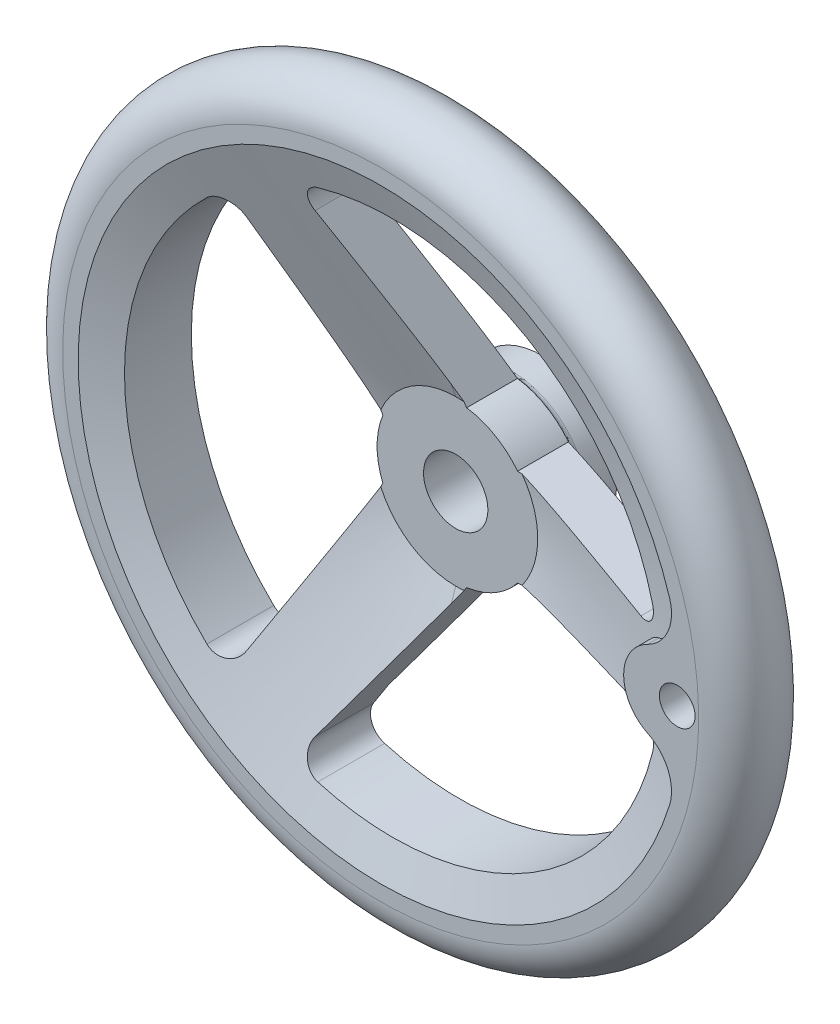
ISO-10303-21;
HEADER;
FILE_DESCRIPTION(('STEP AP214'),'2;1');
FILE_NAME('part.step','',(''),(''),'','','');
FILE_SCHEMA(('AUTOMOTIVE_DESIGN { 1 0 10303 214 1 1 1 1 }'));
ENDSEC;
DATA;
#1=APPLICATION_CONTEXT('core data for automotive mechanical design processes');
#2=APPLICATION_PROTOCOL_DEFINITION('international standard','automotive_design',2000,#1);
#3=PRODUCT_CONTEXT('',#1,'mechanical');
#4=PRODUCT('Part','Part','',(#3));
#5=PRODUCT_RELATED_PRODUCT_CATEGORY('part','',(#4));
#6=PRODUCT_DEFINITION_FORMATION('','',#4);
#7=PRODUCT_DEFINITION_CONTEXT('part definition',#1,'design');
#8=PRODUCT_DEFINITION('design','',#6,#7);
#9=PRODUCT_DEFINITION_SHAPE('','',#8);
#10=(LENGTH_UNIT() NAMED_UNIT(*) SI_UNIT(.MILLI.,.METRE.));
#11=(NAMED_UNIT(*) PLANE_ANGLE_UNIT() SI_UNIT($,.RADIAN.));
#12=(NAMED_UNIT(*) SI_UNIT($,.STERADIAN.) SOLID_ANGLE_UNIT());
#13=UNCERTAINTY_MEASURE_WITH_UNIT(LENGTH_MEASURE(1.E-05),#10,'distance_accuracy_value','');
#14=(GEOMETRIC_REPRESENTATION_CONTEXT(3) GLOBAL_UNCERTAINTY_ASSIGNED_CONTEXT((#13)) GLOBAL_UNIT_ASSIGNED_CONTEXT((#10,
#11,#12)) REPRESENTATION_CONTEXT('',''));
#15=CARTESIAN_POINT('',(0.,0.,0.));
#16=DIRECTION('',(0.,0.,1.));
#17=DIRECTION('',(1.,0.,0.));
#18=AXIS2_PLACEMENT_3D('',#15,#16,#17);
#19=CARTESIAN_POINT('',(0.,0.,9.256002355));
#20=DIRECTION('',(0.,0.,1.));
#21=DIRECTION('',(0.,-1.,0.));
#22=AXIS2_PLACEMENT_3D('',#19,#20,#21);
#23=CONICAL_SURFACE('',#22,20.355704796,1.24279917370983);
#24=CARTESIAN_POINT('',(-19.8827182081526,57.3988340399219,23.0000000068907));
#25=CARTESIAN_POINT('',(-19.0573237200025,56.1177141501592,22.4961663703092));
#26=CARTESIAN_POINT('',(-18.2317634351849,54.836336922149,21.9932550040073));
#27=CARTESIAN_POINT('',(-16.580192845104,52.2728839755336,20.9899215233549));
#28=CARTESIAN_POINT('',(-15.754182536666,50.9908082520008,20.489499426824));
#29=CARTESIAN_POINT('',(-14.1013629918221,48.4254167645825,19.4916501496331));
#30=CARTESIAN_POINT('',(-13.2745535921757,47.1421007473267,18.9942238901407));
#31=CARTESIAN_POINT('',(-11.6202147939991,44.5743511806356,18.0034882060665));
#32=CARTESIAN_POINT('',(-10.7926853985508,43.2899176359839,17.5101787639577));
#33=CARTESIAN_POINT('',(-9.13734841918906,40.7206187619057,16.5294643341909));
#34=CARTESIAN_POINT('',(-8.30954161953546,39.4357546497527,16.042054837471));
#35=CARTESIAN_POINT('',(-6.65262448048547,36.864003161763,15.0747588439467));
#36=CARTESIAN_POINT('',(-5.82351412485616,35.5771157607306,14.5948724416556));
#37=CARTESIAN_POINT('',(-4.57854573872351,33.6447624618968,13.8831413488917));
#38=CARTESIAN_POINT('',(-4.16336447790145,33.0003469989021,13.6472615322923));
#39=CARTESIAN_POINT('',(-3.33246046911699,31.7106756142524,13.178778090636));
#40=CARTESIAN_POINT('',(-2.91673772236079,31.0654196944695,12.9461744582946));
#41=CARTESIAN_POINT('',(-2.08465123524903,29.7739129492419,12.4849689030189));
#42=CARTESIAN_POINT('',(-1.6682875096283,29.1276621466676,12.2563668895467));
#43=CARTESIAN_POINT('',(-0.834775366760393,27.8339425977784,11.8040990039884));
#44=CARTESIAN_POINT('',(-0.417626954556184,27.186473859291,11.5804331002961));
#45=CARTESIAN_POINT('',(0.254294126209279,26.1435647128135,11.2255460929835));
#46=CARTESIAN_POINT('',(0.508765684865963,25.7485916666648,11.0923813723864));
#47=CARTESIAN_POINT('',(1.01811146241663,24.9580205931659,10.8286975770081));
#48=CARTESIAN_POINT('',(1.27298568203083,24.5624225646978,10.6981785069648));
#49=CARTESIAN_POINT('',(1.78321535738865,23.770479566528,10.4401807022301));
#50=CARTESIAN_POINT('',(2.03857086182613,23.374134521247,10.3127022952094));
#51=CARTESIAN_POINT('',(2.54980034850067,22.5806396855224,10.0613139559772));
#52=CARTESIAN_POINT('',(2.80567433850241,22.183489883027,9.9374040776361));
#53=CARTESIAN_POINT('',(3.06183597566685,21.7858936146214,9.81553722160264));
#54=B_SPLINE_CURVE_WITH_KNOTS('',3,(#24,#25,#26,#27,#28,#29,#30,#31,#32,#33,#34,#35,#36,#37,#38,
#39,#40,#41,#42,#43,#44,#45,#46,#47,#48,#49,#50,#51,#52,#53),.UNSPECIFIED.,.F.,.F.,(4,2,2,2,2,2,
2,2,2,2,2,2,2,2,4),(0.,4.81534496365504,9.63072434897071,14.4475156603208,19.2642864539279,
24.0771083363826,28.8899906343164,31.2961385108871,33.7022810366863,36.1083690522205,
38.5144416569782,39.979505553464,41.4445720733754,42.9097957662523,44.3750415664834),.UNSPECIFIED.);
#55=CARTESIAN_POINT('',(-19.8827182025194,57.3988340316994,23.0000000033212));
#56=VERTEX_POINT('',#55);
#57=CARTESIAN_POINT('',(2.8088604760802,22.1785445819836,9.93657949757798));
#58=VERTEX_POINT('',#57);
#59=EDGE_CURVE('E370',#56,#58,#54,.T.);
#60=ORIENTED_EDGE('',*,*,#59,.T.);
#61=CARTESIAN_POINT('',(0.,0.,9.93657949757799));
#62=DIRECTION('',(0.,0.,-1.));
#63=DIRECTION('',(-1.,0.,0.));
#64=AXIS2_PLACEMENT_3D('',#61,#62,#63);
#65=CIRCLE('',#64,22.3557047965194);
#66=CARTESIAN_POINT('',(-20.611613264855,8.65672776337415,9.93657949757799));
#67=VERTEX_POINT('',#66);
#68=EDGE_CURVE('E498',#58,#67,#65,.F.);
#69=ORIENTED_EDGE('',*,*,#68,.T.);
#70=CARTESIAN_POINT('',(-20.3980553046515,8.24131907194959,9.81553722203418));
#71=CARTESIAN_POINT('',(-20.6067638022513,8.64729468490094,9.93315364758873));
#72=CARTESIAN_POINT('',(-20.8152459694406,9.05283004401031,10.0526752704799));
#73=CARTESIAN_POINT('',(-21.2318008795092,9.86310435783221,10.2950597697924));
#74=CARTESIAN_POINT('',(-21.4398736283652,10.2678433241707,10.4179225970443));
#75=CARTESIAN_POINT('',(-21.8556467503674,11.0765969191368,10.6665164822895));
#76=CARTESIAN_POINT('',(-22.0633471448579,11.4806115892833,10.7922473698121));
#77=CARTESIAN_POINT('',(-22.478428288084,12.2880191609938,11.0462129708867));
#78=CARTESIAN_POINT('',(-22.6858090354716,12.6914120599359,11.174447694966));
#79=CARTESIAN_POINT('',(-23.3074607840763,13.9006366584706,11.5623706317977));
#80=CARTESIAN_POINT('',(-23.7213069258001,14.7056419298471,11.8253170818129));
#81=CARTESIAN_POINT('',(-24.5481054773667,16.3139140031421,12.3578832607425));
#82=CARTESIAN_POINT('',(-24.9610578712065,17.1171807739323,12.6275031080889));
#83=CARTESIAN_POINT('',(-25.786152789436,18.7221389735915,13.1719058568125));
#84=CARTESIAN_POINT('',(-26.1982954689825,19.5238307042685,13.4466876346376));
#85=CARTESIAN_POINT('',(-27.0219954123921,21.1260754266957,14.0003918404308));
#86=CARTESIAN_POINT('',(-27.4335526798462,21.9266284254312,14.2793142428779));
#87=CARTESIAN_POINT('',(-28.2562102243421,23.5268454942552,14.840505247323));
#88=CARTESIAN_POINT('',(-28.6673104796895,24.3265095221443,15.1227740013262));
#89=CARTESIAN_POINT('',(-29.489118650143,25.9250744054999,15.6900331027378));
#90=CARTESIAN_POINT('',(-29.8998265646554,26.7239752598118,15.9750234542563));
#91=CARTESIAN_POINT('',(-31.1000612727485,29.0586479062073,16.8114533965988));
#92=CARTESIAN_POINT('',(-31.8891497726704,30.5935671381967,17.3659012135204));
#93=CARTESIAN_POINT('',(-33.4664494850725,33.6616991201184,18.4806125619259));
#94=CARTESIAN_POINT('',(-34.2546607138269,35.1949119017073,19.0408759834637));
#95=CARTESIAN_POINT('',(-35.8305769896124,38.2603528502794,20.1657859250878));
#96=CARTESIAN_POINT('',(-36.6182819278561,39.7925808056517,20.7304331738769));
#97=CARTESIAN_POINT('',(-37.7994801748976,42.090224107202,21.5798358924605));
#98=CARTESIAN_POINT('',(-38.1931561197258,42.8559947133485,21.8633776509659));
#99=CARTESIAN_POINT('',(-38.9804000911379,44.3873260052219,22.4311761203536));
#100=CARTESIAN_POINT('',(-39.3739681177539,45.1528866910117,22.715432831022));
#101=CARTESIAN_POINT('',(-39.7674892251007,45.9183561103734,22.9999999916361));
#102=B_SPLINE_CURVE_WITH_KNOTS('',3,(#70,#71,#72,#73,#74,#75,#76,#77,#78,#79,#80,#81,#82,#83,
#84,#85,#86,#87,#88,#89,#90,#91,#92,#93,#94,#95,#96,#97,#98,#99,#100,#101),.UNSPECIFIED.,.F.,
.F.,(4,2,2,2,2,2,2,2,2,2,2,2,2,2,2,4),(0.,1.41416174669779,2.82830269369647,4.24235980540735,
5.65642286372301,8.4841023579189,11.3118320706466,14.1389532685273,16.9660570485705,
19.7932897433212,22.6205267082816,28.0587494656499,33.4968695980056,38.9359139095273,
41.6554783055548,44.3750418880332),.UNSPECIFIED.);
#103=CARTESIAN_POINT('',(-39.7674892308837,45.9183561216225,22.9999999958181));
#104=VERTEX_POINT('',#103);
#105=EDGE_CURVE('E504',#67,#104,#102,.T.);
#106=ORIENTED_EDGE('',*,*,#105,.T.);
#107=CARTESIAN_POINT('',(0.,0.,23.));
#108=DIRECTION('',(0.,0.,1.));
#109=DIRECTION('',(0.,-1.,0.));
#110=AXIS2_PLACEMENT_3D('',#107,#108,#109);
#111=CIRCLE('',#110,60.744947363);
#112=EDGE_CURVE('E256',#104,#56,#111,.F.);
#113=ORIENTED_EDGE('',*,*,#112,.T.);
#114=EDGE_LOOP('',(#60,#69,#106,#113));
#115=FACE_BOUND('',#114,.T.);
#116=ADVANCED_FACE('F15',(#115),#23,.T.);
#117=CARTESIAN_POINT('',(-39.7674892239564,-45.9183561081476,22.9999999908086));
#118=CARTESIAN_POINT('',(-39.3661933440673,-45.1377633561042,22.7098105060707));
#119=CARTESIAN_POINT('',(-38.9648486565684,-44.3570756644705,22.4199440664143));
#120=CARTESIAN_POINT('',(-38.1620466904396,-42.7954812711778,21.8409565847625));
#121=CARTESIAN_POINT('',(-37.7605894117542,-42.0145745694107,21.5518355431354));
#122=CARTESIAN_POINT('',(-36.5560254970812,-39.6714808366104,20.6857389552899));
#123=CARTESIAN_POINT('',(-35.7527281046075,-38.10892274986,20.1100309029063));
#124=CARTESIAN_POINT('',(-34.5473505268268,-35.7642462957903,19.2499115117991));
#125=CARTESIAN_POINT('',(-34.1455231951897,-34.9826197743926,18.9638050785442));
#126=CARTESIAN_POINT('',(-33.3416712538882,-33.4189829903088,18.3929233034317));
#127=CARTESIAN_POINT('',(-32.9396466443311,-32.6369727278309,18.1081479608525));
#128=CARTESIAN_POINT('',(-31.7332146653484,-30.2902452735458,17.2561290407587));
#129=CARTESIAN_POINT('',(-30.9284640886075,-28.7248604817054,16.6912032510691));
#130=CARTESIAN_POINT('',(-29.7202793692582,-26.3747236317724,15.8503596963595));
#131=CARTESIAN_POINT('',(-29.317326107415,-25.5909069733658,15.5711361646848));
#132=CARTESIAN_POINT('',(-28.5110322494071,-24.0225202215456,15.0153795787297));
#133=CARTESIAN_POINT('',(-28.1076916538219,-23.2379501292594,14.7388465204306));
#134=CARTESIAN_POINT('',(-27.3005602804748,-21.6679342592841,14.189079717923));
#135=CARTESIAN_POINT('',(-26.8967695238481,-20.8824885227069,13.9158458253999));
#136=CARTESIAN_POINT('',(-26.0886133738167,-19.3104792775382,13.3734496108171));
#137=CARTESIAN_POINT('',(-25.684247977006,-18.5239157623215,13.1042873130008));
#138=CARTESIAN_POINT('',(-24.8747251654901,-16.9492481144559,12.5710215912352));
#139=CARTESIAN_POINT('',(-24.4695675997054,-16.1611436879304,12.306919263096));
#140=CARTESIAN_POINT('',(-23.6583807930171,-14.5832392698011,11.7852322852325));
#141=CARTESIAN_POINT('',(-23.252351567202,-13.7934393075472,11.5276475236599));
#142=CARTESIAN_POINT('',(-22.6424509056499,-12.6070726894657,11.1475884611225));
#143=CARTESIAN_POINT('',(-22.4389920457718,-12.2113085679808,11.021945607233));
#144=CARTESIAN_POINT('',(-22.0317646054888,-11.4191778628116,10.7730887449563));
#145=CARTESIAN_POINT('',(-21.827996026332,-11.0228112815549,10.6498747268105));
#146=CARTESIAN_POINT('',(-21.4200991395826,-10.2293783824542,10.4062221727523));
#147=CARTESIAN_POINT('',(-21.2159708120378,-9.83231202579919,10.285783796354));
#148=CARTESIAN_POINT('',(-20.807319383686,-9.03741140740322,10.0481311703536));
#149=CARTESIAN_POINT('',(-20.6027962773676,-8.63957713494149,9.93091696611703));
#150=CARTESIAN_POINT('',(-20.3980553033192,-8.24131907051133,9.81553722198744));
#151=B_SPLINE_CURVE_WITH_KNOTS('',3,(#117,#118,#119,#120,#121,#122,#123,#124,#125,#126,#127,
#128,#129,#130,#131,#132,#133,#134,#135,#136,#137,#138,#139,#140,#141,#142,#143,#144,#145,#146,
#147,#148,#149,#150),.UNSPECIFIED.,.F.,.F.,(4,2,2,2,2,2,2,2,2,2,2,2,2,2,2,2,4),(0.,
2.77329390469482,5.54658917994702,11.0931888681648,13.8659768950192,16.6387634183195,
22.1844396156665,24.9579452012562,27.7314466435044,30.504822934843,33.2782157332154,
36.052202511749,38.8261416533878,40.2133267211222,41.6005062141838,42.9877652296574,
44.375043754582),.UNSPECIFIED.);
#152=CARTESIAN_POINT('',(-39.7674892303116,-45.9183561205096,22.9999999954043));
#153=VERTEX_POINT('',#152);
#154=CARTESIAN_POINT('',(-20.611613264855,-8.65672776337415,9.93657949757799));
#155=VERTEX_POINT('',#154);
#156=EDGE_CURVE('E503',#153,#155,#151,.T.);
#157=ORIENTED_EDGE('',*,*,#156,.T.);
#158=CARTESIAN_POINT('',(0.,0.,9.93657949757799));
#159=DIRECTION('',(0.,0.,-1.));
#160=DIRECTION('',(-1.,0.,0.));
#161=AXIS2_PLACEMENT_3D('',#158,#159,#160);
#162=CIRCLE('',#161,22.3557047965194);
#163=CARTESIAN_POINT('',(2.80886047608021,-22.1785445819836,9.93657949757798));
#164=VERTEX_POINT('',#163);
#165=EDGE_CURVE('E867',#155,#164,#162,.F.);
#166=ORIENTED_EDGE('',*,*,#165,.T.);
#167=CARTESIAN_POINT('',(3.06183597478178,-21.785893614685,9.81553722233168));
#168=CARTESIAN_POINT('',(2.80567195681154,-22.1834935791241,9.93740502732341));
#169=CARTESIAN_POINT('',(2.5497956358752,-22.5806469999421,10.0613161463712));
#170=CARTESIAN_POINT('',(2.03856183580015,-23.3741485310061,10.3127068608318));
#171=CARTESIAN_POINT('',(1.78320434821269,-23.7704966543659,10.4401863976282));
#172=CARTESIAN_POINT('',(1.27297537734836,-24.5624385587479,10.6981835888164));
#173=CARTESIAN_POINT('',(1.0181038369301,-24.9580324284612,10.8287008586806));
#174=CARTESIAN_POINT('',(0.508762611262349,-25.7485964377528,11.0923836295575));
#175=CARTESIAN_POINT('',(0.254292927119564,-26.1435665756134,11.2255491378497));
#176=CARTESIAN_POINT('',(-0.59166348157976,-27.4566012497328,11.6723479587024));
#177=CARTESIAN_POINT('',(-1.18237012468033,-28.3734549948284,11.9910188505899));
#178=CARTESIAN_POINT('',(-2.36233780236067,-30.2049187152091,12.6373718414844));
#179=CARTESIAN_POINT('',(-2.95159881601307,-31.1195286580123,12.9650540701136));
#180=CARTESIAN_POINT('',(-4.12903106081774,-32.9470570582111,13.6271924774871));
#181=CARTESIAN_POINT('',(-4.71720224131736,-33.8599754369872,13.9616489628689));
#182=CARTESIAN_POINT('',(-5.89267091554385,-35.6844561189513,14.6357266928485));
#183=CARTESIAN_POINT('',(-6.47996841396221,-36.5960184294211,14.9753479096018));
#184=CARTESIAN_POINT('',(-7.65401892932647,-38.4182979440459,15.6587012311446));
#185=CARTESIAN_POINT('',(-8.24077177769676,-39.3290148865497,16.002434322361));
#186=CARTESIAN_POINT('',(-9.41372621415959,-41.1495931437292,16.6930939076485));
#187=CARTESIAN_POINT('',(-9.99992780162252,-42.0594544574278,17.040020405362));
#188=CARTESIAN_POINT('',(-11.1718684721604,-43.8784592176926,17.7364330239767));
#189=CARTESIAN_POINT('',(-11.7576075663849,-44.7876026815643,18.0859190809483));
#190=CARTESIAN_POINT('',(-12.9287177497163,-46.6053184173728,18.7869873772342));
#191=CARTESIAN_POINT('',(-13.5140888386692,-47.5138906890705,19.1385696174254));
#192=CARTESIAN_POINT('',(-15.0640206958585,-49.9195870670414,20.072003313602));
#193=CARTESIAN_POINT('',(-16.0283202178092,-51.4163056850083,20.6553335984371));
#194=CARTESIAN_POINT('',(-17.4741881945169,-53.6604813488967,21.5328702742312));
#195=CARTESIAN_POINT('',(-17.9559894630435,-54.4082997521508,21.8257707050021));
#196=CARTESIAN_POINT('',(-18.9194530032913,-55.9037208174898,22.4123369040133));
#197=CARTESIAN_POINT('',(-19.4011152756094,-56.6513234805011,22.7060026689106));
#198=CARTESIAN_POINT('',(-19.8827182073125,-57.398834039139,23.0000000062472));
#199=B_SPLINE_CURVE_WITH_KNOTS('',3,(#167,#168,#169,#170,#171,#172,#173,#174,#175,#176,#177,
#178,#179,#180,#181,#182,#183,#184,#185,#186,#187,#188,#189,#190,#191,#192,#193,#194,#195,#196,
#197,#198),.UNSPECIFIED.,.F.,.F.,(4,2,2,2,2,2,2,2,2,2,2,2,2,2,2,4),(0.,1.46525924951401,
2.9304944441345,4.39554516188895,5.8605999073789,9.26934333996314,12.6781358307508,
16.0870829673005,19.4960117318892,22.9057753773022,26.315542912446,29.725225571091,
33.1349096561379,38.755653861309,41.565351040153,44.3750359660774),.UNSPECIFIED.);
#200=CARTESIAN_POINT('',(-19.8827182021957,-57.3988340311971,23.0000000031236));
#201=VERTEX_POINT('',#200);
#202=EDGE_CURVE('E509',#164,#201,#199,.T.);
#203=ORIENTED_EDGE('',*,*,#202,.T.);
#204=CARTESIAN_POINT('',(0.,0.,23.));
#205=DIRECTION('',(0.,0.,1.));
#206=DIRECTION('',(0.,-1.,0.));
#207=AXIS2_PLACEMENT_3D('',#204,#205,#206);
#208=CIRCLE('',#207,60.744947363);
#209=EDGE_CURVE('E272',#201,#153,#208,.F.);
#210=ORIENTED_EDGE('',*,*,#209,.T.);
#211=EDGE_LOOP('',(#157,#166,#203,#210));
#212=FACE_BOUND('',#211,.T.);
#213=ADVANCED_FACE('F719',(#212),#23,.T.);
#214=CARTESIAN_POINT('',(-19.29416296,19.228,0.));
#215=DIRECTION('',(0.,0.,1.));
#216=DIRECTION('',(0.,-1.,0.));
#217=AXIS2_PLACEMENT_3D('',#214,#215,#216);
#218=PLANE('',#217);
#219=CARTESIAN_POINT('',(0.,0.,0.));
#220=DIRECTION('',(0.,0.,1.));
#221=DIRECTION('',(0.,-1.,0.));
#222=AXIS2_PLACEMENT_3D('',#219,#220,#221);
#223=CIRCLE('',#222,9.);
#224=CARTESIAN_POINT('',(0.,-9.,0.));
#225=VERTEX_POINT('',#224);
#226=EDGE_CURVE('E698',#225,#225,#223,.T.);
#227=ORIENTED_EDGE('',*,*,#226,.T.);
#228=EDGE_LOOP('',(#227));
#229=FACE_BOUND('',#228,.T.);
#230=CARTESIAN_POINT('',(0.,0.,0.));
#231=DIRECTION('',(0.,0.,-1.));
#232=DIRECTION('',(-1.,0.,0.));
#233=AXIS2_PLACEMENT_3D('',#230,#231,#232);
#234=CIRCLE('',#233,21.);
#235=CARTESIAN_POINT('',(-21.,0.,0.));
#236=VERTEX_POINT('',#235);
#237=EDGE_CURVE('E702',#236,#236,#234,.T.);
#238=ORIENTED_EDGE('',*,*,#237,.T.);
#239=EDGE_LOOP('',(#238));
#240=FACE_BOUND('',#239,.T.);
#241=ADVANCED_FACE('F720',(#229,#240),#218,.F.);
#242=CARTESIAN_POINT('',(69.405690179,21.535101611,41.852277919));
#243=DIRECTION('',(0.,0.,1.));
#244=DIRECTION('',(0.,-1.,0.));
#245=AXIS2_PLACEMENT_3D('',#242,#243,#244);
#246=CYLINDRICAL_SURFACE('',#245,12.);
#247=CARTESIAN_POINT('',(80.8741519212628,25.0670111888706,44.999999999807));
#248=CARTESIAN_POINT('',(80.9705563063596,24.7541218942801,44.9998073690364));
#249=CARTESIAN_POINT('',(81.0540714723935,24.4372758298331,44.9956835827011));
#250=CARTESIAN_POINT('',(81.194917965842,23.7980489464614,44.9796416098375));
#251=CARTESIAN_POINT('',(81.2522524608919,23.4756688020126,44.9677243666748));
#252=CARTESIAN_POINT('',(81.3402804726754,22.8282292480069,44.936190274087));
#253=CARTESIAN_POINT('',(81.3710193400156,22.503175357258,44.9165866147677));
#254=CARTESIAN_POINT('',(81.4059271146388,21.8521899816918,44.86980798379));
#255=CARTESIAN_POINT('',(81.4100959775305,21.5262584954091,44.842632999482));
#256=CARTESIAN_POINT('',(81.3919823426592,20.8758045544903,44.7808802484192));
#257=CARTESIAN_POINT('',(81.3696970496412,20.5512822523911,44.7463016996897));
#258=CARTESIAN_POINT('',(81.2990168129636,19.9059460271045,44.6699590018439));
#259=CARTESIAN_POINT('',(81.2506213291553,19.5851321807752,44.6281947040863));
#260=CARTESIAN_POINT('',(81.1282768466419,18.9494229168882,44.537737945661));
#261=CARTESIAN_POINT('',(81.0543285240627,18.6345273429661,44.4890456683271));
#262=CARTESIAN_POINT('',(80.8816259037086,18.0127424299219,44.3850238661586));
#263=CARTESIAN_POINT('',(80.7828714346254,17.7058531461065,44.329694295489));
#264=CARTESIAN_POINT('',(80.5597344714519,17.0973130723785,44.2118010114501));
#265=CARTESIAN_POINT('',(80.4349734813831,16.7958204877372,44.1491372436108));
#266=CARTESIAN_POINT('',(80.1619322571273,16.2050786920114,44.0176635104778));
#267=CARTESIAN_POINT('',(80.0136516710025,15.9158296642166,43.9488534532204));
#268=CARTESIAN_POINT('',(79.6947550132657,15.3512260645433,43.8054447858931));
#269=CARTESIAN_POINT('',(79.524127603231,15.0758786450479,43.7308432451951));
#270=CARTESIAN_POINT('',(79.161982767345,14.5408823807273,43.5763001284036));
#271=CARTESIAN_POINT('',(78.9704654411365,14.2812334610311,43.496358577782));
#272=CARTESIAN_POINT('',(78.5602323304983,13.7694055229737,43.3283821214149));
#273=CARTESIAN_POINT('',(78.3407514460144,13.5179030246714,43.2401538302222));
#274=CARTESIAN_POINT('',(77.8825782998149,13.0349148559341,43.0589070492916));
#275=CARTESIAN_POINT('',(77.6438852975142,12.803429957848,42.9658883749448));
#276=CARTESIAN_POINT('',(77.1493594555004,12.362024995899,42.7756846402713));
#277=CARTESIAN_POINT('',(76.893544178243,12.1520833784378,42.6785038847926));
#278=CARTESIAN_POINT('',(76.3664935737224,11.7547094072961,42.4804565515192));
#279=CARTESIAN_POINT('',(76.095264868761,11.5672674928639,42.3795915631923));
#280=CARTESIAN_POINT('',(75.6367468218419,11.2774428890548,42.210641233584));
#281=CARTESIAN_POINT('',(75.4533703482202,11.1682799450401,42.1434625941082));
#282=CARTESIAN_POINT('',(75.0817245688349,10.9602300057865,42.00804429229));
#283=CARTESIAN_POINT('',(74.8934644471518,10.8613252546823,41.9398067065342));
#284=CARTESIAN_POINT('',(74.702845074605,10.7675508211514,41.8710516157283));
#285=B_SPLINE_CURVE_WITH_KNOTS('',3,(#247,#248,#249,#250,#251,#252,#253,#254,#255,#256,#257,
#258,#259,#260,#261,#262,#263,#264,#265,#266,#267,#268,#269,#270,#271,#272,#273,#274,#275,#276,
#277,#278,#279,#280,#281,#282,#283,#284),.UNSPECIFIED.,.F.,.F.,(4,2,2,2,2,2,2,2,2,2,2,2,2,2,2,2,
2,2,4),(0.,0.981899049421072,1.96367926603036,2.94378204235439,3.92388645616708,
4.90409444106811,5.88432270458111,6.86452503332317,7.84473413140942,8.84035331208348,
9.83598739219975,10.8321286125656,11.828265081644,12.8629000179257,13.8975748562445,
14.9312042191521,15.9643927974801,16.6353213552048,17.3050685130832),.UNSPECIFIED.);
#286=CARTESIAN_POINT('',(80.8741518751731,25.0670113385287,44.9999999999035));
#287=VERTEX_POINT('',#286);
#288=CARTESIAN_POINT('',(74.7028450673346,10.7675508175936,41.8710516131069));
#289=VERTEX_POINT('',#288);
#290=EDGE_CURVE('E899',#287,#289,#285,.T.);
#291=ORIENTED_EDGE('',*,*,#290,.T.);
#292=DIRECTION('',(0.,0.,-1.));
#293=VECTOR('',#292,1.);
#294=CARTESIAN_POINT('',(74.702845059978,10.7675508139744,42.1337841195));
#295=LINE('',#294,#293);
#296=CARTESIAN_POINT('',(74.7028450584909,10.7675508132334,45.));
#297=VERTEX_POINT('',#296);
#298=EDGE_CURVE('E699',#297,#289,#295,.T.);
#299=ORIENTED_EDGE('',*,*,#298,.F.);
#300=CARTESIAN_POINT('',(69.405690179,21.535101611,45.));
#301=DIRECTION('',(0.,0.,1.));
#302=DIRECTION('',(0.,-1.,0.));
#303=AXIS2_PLACEMENT_3D('',#300,#301,#302);
#304=CIRCLE('',#303,12.);
#305=EDGE_CURVE('E891',#297,#287,#304,.T.);
#306=ORIENTED_EDGE('',*,*,#305,.T.);
#307=EDGE_LOOP('',(#291,#299,#306));
#308=FACE_BOUND('',#307,.T.);
#309=ADVANCED_FACE('F723',(#308),#246,.F.);
#310=CARTESIAN_POINT('',(79.999999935,1.39999999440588E-08,39.2930554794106));
#311=DIRECTION('',(0.,0.,1.));
#312=DIRECTION('',(0.,-1.,0.));
#313=AXIS2_PLACEMENT_3D('',#310,#311,#312);
#314=CYLINDRICAL_SURFACE('',#313,12.);
#315=DIRECTION('',(0.,0.,1.));
#316=VECTOR('',#315,1.);
#317=CARTESIAN_POINT('',(74.7028450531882,-10.7675507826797,43.426138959));
#318=LINE('',#317,#316);
#319=CARTESIAN_POINT('',(74.7028450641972,-10.7675507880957,41.8710516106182));
#320=VERTEX_POINT('',#319);
#321=CARTESIAN_POINT('',(74.7028450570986,-10.7675507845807,45.));
#322=VERTEX_POINT('',#321);
#323=EDGE_CURVE('E695',#320,#322,#318,.T.);
#324=ORIENTED_EDGE('',*,*,#323,.T.);
#325=CARTESIAN_POINT('',(79.999999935,1.39999999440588E-08,45.));
#326=DIRECTION('',(0.,0.,1.));
#327=DIRECTION('',(0.,-1.,0.));
#328=AXIS2_PLACEMENT_3D('',#325,#326,#327);
#329=CIRCLE('',#328,12.);
#330=EDGE_CURVE('E901',#322,#297,#329,.F.);
#331=ORIENTED_EDGE('',*,*,#330,.T.);
#332=ORIENTED_EDGE('',*,*,#298,.T.);
#333=CARTESIAN_POINT('',(74.7028450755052,10.7675508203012,41.8710516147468));
#334=CARTESIAN_POINT('',(74.398503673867,10.6178550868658,41.7612856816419));
#335=CARTESIAN_POINT('',(74.1000946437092,10.4550000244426,41.6529415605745));
#336=CARTESIAN_POINT('',(73.5171349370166,10.1038667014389,41.4399782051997));
#337=CARTESIAN_POINT('',(73.2325874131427,9.91558269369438,41.3353598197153));
#338=CARTESIAN_POINT('',(72.6788552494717,9.51409969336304,41.1305471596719));
#339=CARTESIAN_POINT('',(72.4097070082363,9.30084502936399,41.0303634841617));
#340=CARTESIAN_POINT('',(71.8895621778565,8.8509333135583,40.8356397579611));
#341=CARTESIAN_POINT('',(71.6385641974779,8.61427805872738,40.7410992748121));
#342=CARTESIAN_POINT('',(71.1562710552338,8.11839393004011,40.5584564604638));
#343=CARTESIAN_POINT('',(70.9250157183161,7.85912146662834,40.4703671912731));
#344=CARTESIAN_POINT('',(70.4848036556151,7.31998226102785,40.3018431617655));
#345=CARTESIAN_POINT('',(70.2758456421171,7.04011670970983,40.22140795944));
#346=CARTESIAN_POINT('',(69.882393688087,6.46190312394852,40.0692709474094));
#347=CARTESIAN_POINT('',(69.6978734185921,6.16357549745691,39.9975597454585));
#348=CARTESIAN_POINT('',(69.354898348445,5.55024691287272,39.8637418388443));
#349=CARTESIAN_POINT('',(69.1964419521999,5.23524697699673,39.8016345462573));
#350=CARTESIAN_POINT('',(68.9143059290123,4.60654858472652,39.6906855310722));
#351=CARTESIAN_POINT('',(68.7893130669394,4.29352689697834,39.6413467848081));
#352=CARTESIAN_POINT('',(68.5657601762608,3.65677489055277,39.552880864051));
#353=CARTESIAN_POINT('',(68.467199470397,3.33304484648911,39.5137534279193));
#354=CARTESIAN_POINT('',(68.2975917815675,2.6773695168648,39.446297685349));
#355=CARTESIAN_POINT('',(68.2265432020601,2.3454247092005,39.4179687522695));
#356=CARTESIAN_POINT('',(68.1127624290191,1.67596166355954,39.3725510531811));
#357=CARTESIAN_POINT('',(68.0700289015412,1.33844368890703,39.3554617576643));
#358=CARTESIAN_POINT('',(68.0150882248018,0.681161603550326,39.3334825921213));
#359=CARTESIAN_POINT('',(68.0011890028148,0.361560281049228,39.3279165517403));
#360=CARTESIAN_POINT('',(67.9989572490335,-0.277737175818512,39.3270231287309));
#361=CARTESIAN_POINT('',(68.0106235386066,-0.597433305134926,39.3316952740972));
#362=CARTESIAN_POINT('',(68.0593950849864,-1.23450486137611,39.3512085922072));
#363=CARTESIAN_POINT('',(68.0964958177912,-1.55188069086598,39.3660479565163));
#364=CARTESIAN_POINT('',(68.1957479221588,-2.1820581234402,39.4056823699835));
#365=CARTESIAN_POINT('',(68.2578993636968,-2.49485971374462,39.4304774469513));
#366=CARTESIAN_POINT('',(68.4053404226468,-3.10832316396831,39.4891674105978));
#367=CARTESIAN_POINT('',(68.4902124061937,-3.40910135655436,39.5228979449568));
#368=CARTESIAN_POINT('',(68.6827427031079,-4.00210819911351,39.5992049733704));
#369=CARTESIAN_POINT('',(68.7904006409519,-4.29433698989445,39.6417813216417));
#370=CARTESIAN_POINT('',(69.0275387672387,-4.86842422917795,39.7352583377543));
#371=CARTESIAN_POINT('',(69.1570195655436,-5.15028238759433,39.7861592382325));
#372=CARTESIAN_POINT('',(69.4366969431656,-5.70195388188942,39.8956943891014));
#373=CARTESIAN_POINT('',(69.5868939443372,-5.97176697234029,39.9543287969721));
#374=CARTESIAN_POINT('',(69.912468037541,-6.50717386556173,40.0808997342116));
#375=CARTESIAN_POINT('',(70.0885489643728,-6.77227909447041,40.1490923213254));
#376=CARTESIAN_POINT('',(70.4602664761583,-7.28657660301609,40.2923742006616));
#377=CARTESIAN_POINT('',(70.6559106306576,-7.53576266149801,40.3674661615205));
#378=CARTESIAN_POINT('',(71.0652045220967,-8.01680537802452,40.5237695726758));
#379=CARTESIAN_POINT('',(71.2788541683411,-8.24866212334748,40.6049809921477));
#380=CARTESIAN_POINT('',(71.7227071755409,-8.69397895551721,40.7727990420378));
#381=CARTESIAN_POINT('',(71.9529150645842,-8.90743397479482,40.8594071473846));
#382=CARTESIAN_POINT('',(72.3828351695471,-9.27593339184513,41.0202542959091));
#383=CARTESIAN_POINT('',(72.5799725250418,-9.43434663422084,41.0936958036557));
#384=CARTESIAN_POINT('',(72.9832013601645,-9.73797858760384,41.243227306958));
#385=CARTESIAN_POINT('',(73.1892926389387,-9.88319759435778,41.3193172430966));
#386=CARTESIAN_POINT('',(73.6091360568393,-10.1597193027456,41.473601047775));
#387=CARTESIAN_POINT('',(73.8228703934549,-10.2910518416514,41.5517899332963));
#388=CARTESIAN_POINT('',(74.2576110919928,-10.5398166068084,41.7100778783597));
#389=CARTESIAN_POINT('',(74.4786177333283,-10.6572482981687,41.7901770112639));
#390=CARTESIAN_POINT('',(74.7028450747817,-10.7675507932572,41.8710516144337));
#391=B_SPLINE_CURVE_WITH_KNOTS('',3,(#333,#334,#335,#336,#337,#338,#339,#340,#341,#342,#343,
#344,#345,#346,#347,#348,#349,#350,#351,#352,#353,#354,#355,#356,#357,#358,#359,#360,#361,#362,
#363,#364,#365,#366,#367,#368,#369,#370,#371,#372,#373,#374,#375,#376,#377,#378,#379,#380,#381,
#382,#383,#384,#385,#386,#387,#388,#389,#390),.UNSPECIFIED.,.F.,.F.,(4,2,2,2,2,2,2,2,2,2,2,2,2,
2,2,2,2,2,2,2,2,2,2,2,2,2,2,2,4),(0.,1.06919597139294,2.13863399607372,3.21050340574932,
4.28229056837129,5.35619103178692,6.43002944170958,7.50270133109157,8.57530752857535,
9.59593150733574,10.6165293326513,11.6370679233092,12.6575584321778,13.616243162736,
14.5748836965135,15.5333537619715,16.4918265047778,17.4337653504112,18.3756886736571,
19.3176383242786,20.2596071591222,21.2349657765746,22.2107032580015,23.1864358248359,
24.1624362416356,24.9519981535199,25.7415423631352,26.5293540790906,27.3171960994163),.UNSPECIFIED.);
#392=EDGE_CURVE('E835',#289,#320,#391,.T.);
#393=ORIENTED_EDGE('',*,*,#392,.T.);
#394=EDGE_LOOP('',(#324,#331,#332,#393));
#395=FACE_BOUND('',#394,.T.);
#396=ADVANCED_FACE('F847',(#395),#314,.T.);
#397=CARTESIAN_POINT('',(69.405690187,-21.535101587,41.852277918));
#398=DIRECTION('',(0.,0.,1.));
#399=DIRECTION('',(0.,-1.,0.));
#400=AXIS2_PLACEMENT_3D('',#397,#398,#399);
#401=CYLINDRICAL_SURFACE('',#400,12.);
#402=CARTESIAN_POINT('',(74.7028450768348,-10.7675507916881,41.8710516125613));
#403=CARTESIAN_POINT('',(75.0108325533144,-10.9190337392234,41.9821417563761));
#404=CARTESIAN_POINT('',(75.3126997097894,-11.0839822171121,42.0918932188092));
#405=CARTESIAN_POINT('',(75.9020679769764,-11.4397861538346,42.3080958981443));
#406=CARTESIAN_POINT('',(76.1895669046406,-11.630645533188,42.4145466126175));
#407=CARTESIAN_POINT('',(76.7484216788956,-12.0375231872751,42.6236566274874));
#408=CARTESIAN_POINT('',(77.0197511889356,-12.253580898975,42.7263096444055));
#409=CARTESIAN_POINT('',(77.5436143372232,-12.709304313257,42.9270193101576));
#410=CARTESIAN_POINT('',(77.796149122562,-12.9489685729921,43.0250762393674));
#411=CARTESIAN_POINT('',(78.2807084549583,-13.4508027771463,43.2161369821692));
#412=CARTESIAN_POINT('',(78.512702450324,-13.7130051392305,43.3091331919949));
#413=CARTESIAN_POINT('',(78.9537377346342,-14.2579019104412,43.4893284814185));
#414=CARTESIAN_POINT('',(79.1627798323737,-14.5405955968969,43.5765277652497));
#415=CARTESIAN_POINT('',(79.5558052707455,-15.1242653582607,43.7444836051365));
#416=CARTESIAN_POINT('',(79.7398139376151,-15.4252225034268,43.8252466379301));
#417=CARTESIAN_POINT('',(80.0812445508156,-16.0435400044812,43.9798914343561));
#418=CARTESIAN_POINT('',(80.2386675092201,-16.3608997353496,44.053773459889));
#419=CARTESIAN_POINT('',(80.5205549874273,-16.9988778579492,44.1918177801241));
#420=CARTESIAN_POINT('',(80.6459417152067,-17.3190366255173,44.2562216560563));
#421=CARTESIAN_POINT('',(80.8691021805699,-17.9701857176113,44.3777072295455));
#422=CARTESIAN_POINT('',(80.9668767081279,-18.3011757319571,44.4347891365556));
#423=CARTESIAN_POINT('',(81.1337751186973,-18.9716284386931,44.5412636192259));
#424=CARTESIAN_POINT('',(81.2028903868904,-19.3110936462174,44.5906538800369));
#425=CARTESIAN_POINT('',(81.3115980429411,-19.9957774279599,44.6813823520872));
#426=CARTESIAN_POINT('',(81.3511905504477,-20.3409959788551,44.7227205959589));
#427=CARTESIAN_POINT('',(81.4016848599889,-21.0543318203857,44.799181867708));
#428=CARTESIAN_POINT('',(81.4108154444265,-21.4226291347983,44.8338139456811));
#429=CARTESIAN_POINT('',(81.3951092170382,-22.1592814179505,44.8934721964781));
#430=CARTESIAN_POINT('',(81.3702704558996,-22.5276363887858,44.9184978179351));
#431=CARTESIAN_POINT('',(81.2865346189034,-23.262074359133,44.9587917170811));
#432=CARTESIAN_POINT('',(81.2275458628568,-23.6281485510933,44.9740334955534));
#433=CARTESIAN_POINT('',(81.1138342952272,-24.1720959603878,44.989401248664));
#434=CARTESIAN_POINT('',(81.0717142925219,-24.3525881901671,44.993274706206));
#435=CARTESIAN_POINT('',(80.9791521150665,-24.7114692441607,44.9985169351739));
#436=CARTESIAN_POINT('',(80.9287096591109,-24.8898579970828,44.9998856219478));
#437=CARTESIAN_POINT('',(80.8741519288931,-25.0670111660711,44.9999999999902));
#438=B_SPLINE_CURVE_WITH_KNOTS('',3,(#402,#403,#404,#405,#406,#407,#408,#409,#410,#411,#412,
#413,#414,#415,#416,#417,#418,#419,#420,#421,#422,#423,#424,#425,#426,#427,#428,#429,#430,#431,
#432,#433,#434,#435,#436,#437),.UNSPECIFIED.,.F.,.F.,(4,2,2,2,2,2,2,2,2,2,2,2,2,2,2,2,2,4),(0.,
1.0819890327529,2.16414196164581,3.24801184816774,4.33181552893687,5.41720505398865,
6.50255631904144,7.58680123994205,8.67100487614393,9.71914038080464,10.7672458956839,
11.8156662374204,12.864082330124,13.9724857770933,15.0809528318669,16.1924096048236,
16.7483697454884,17.3043486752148),.UNSPECIFIED.);
#439=CARTESIAN_POINT('',(80.8741519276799,-25.0670111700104,45.));
#440=VERTEX_POINT('',#439);
#441=EDGE_CURVE('E826',#320,#440,#438,.T.);
#442=ORIENTED_EDGE('',*,*,#441,.T.);
#443=CARTESIAN_POINT('',(69.405690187,-21.535101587,45.));
#444=DIRECTION('',(0.,0.,1.));
#445=DIRECTION('',(0.,-1.,0.));
#446=AXIS2_PLACEMENT_3D('',#443,#444,#445);
#447=CIRCLE('',#446,12.);
#448=EDGE_CURVE('E894',#440,#322,#447,.T.);
#449=ORIENTED_EDGE('',*,*,#448,.T.);
#450=ORIENTED_EDGE('',*,*,#323,.F.);
#451=EDGE_LOOP('',(#442,#449,#450));
#452=FACE_BOUND('',#451,.T.);
#453=ADVANCED_FACE('F842',(#452),#401,.F.);
#454=CARTESIAN_POINT('',(0.,0.,0.));
#455=DIRECTION('',(0.,0.,1.));
#456=DIRECTION('',(0.,-1.,0.));
#457=AXIS2_PLACEMENT_3D('',#454,#455,#456);
#458=CYLINDRICAL_SURFACE('',#457,9.);
#459=CARTESIAN_POINT('',(0.,0.,24.));
#460=DIRECTION('',(0.,0.,1.));
#461=DIRECTION('',(0.,-1.,0.));
#462=AXIS2_PLACEMENT_3D('',#459,#460,#461);
#463=CIRCLE('',#462,9.);
#464=CARTESIAN_POINT('',(0.,-9.,24.));
#465=VERTEX_POINT('',#464);
#466=EDGE_CURVE('E812',#465,#465,#463,.T.);
#467=ORIENTED_EDGE('',*,*,#466,.T.);
#468=EDGE_LOOP('',(#467));
#469=FACE_BOUND('',#468,.T.);
#470=ORIENTED_EDGE('',*,*,#226,.F.);
#471=EDGE_LOOP('',(#470));
#472=FACE_BOUND('',#471,.T.);
#473=ADVANCED_FACE('F846',(#469,#472),#458,.F.);
#474=CARTESIAN_POINT('',(0.,0.,9.81553722));
#475=DIRECTION('',(0.,0.,1.));
#476=DIRECTION('',(0.,-1.,0.));
#477=AXIS2_PLACEMENT_3D('',#474,#475,#476);
#478=CYLINDRICAL_SURFACE('',#477,22.);
#479=DIRECTION('',(0.,0.,-1.));
#480=VECTOR('',#479,1.);
#481=CARTESIAN_POINT('',(17.336219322,13.544574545,24.59385538));
#482=LINE('',#481,#480);
#483=CARTESIAN_POINT('',(17.3362193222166,13.5445745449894,24.0000000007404));
#484=VERTEX_POINT('',#483);
#485=CARTESIAN_POINT('',(17.336219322,13.544574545,9.77525139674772));
#486=VERTEX_POINT('',#485);
#487=EDGE_CURVE('E43',#484,#486,#482,.T.);
#488=ORIENTED_EDGE('',*,*,#487,.T.);
#489=CARTESIAN_POINT('',(0.,0.,9.77525139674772));
#490=DIRECTION('',(0.,0.,-1.));
#491=DIRECTION('',(-1.,0.,0.));
#492=AXIS2_PLACEMENT_3D('',#489,#490,#491);
#493=CIRCLE('',#492,22.);
#494=CARTESIAN_POINT('',(3.061835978,21.785893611,9.77525139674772));
#495=VERTEX_POINT('',#494);
#496=EDGE_CURVE('E30',#486,#495,#493,.F.);
#497=ORIENTED_EDGE('',*,*,#496,.T.);
#498=DIRECTION('',(0.,0.,1.));
#499=VECTOR('',#498,1.);
#500=CARTESIAN_POINT('',(3.061835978,21.785893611,24.5938553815));
#501=LINE('',#500,#499);
#502=CARTESIAN_POINT('',(3.06183597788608,21.7858936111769,24.0000000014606));
#503=VERTEX_POINT('',#502);
#504=EDGE_CURVE('E36',#495,#503,#501,.T.);
#505=ORIENTED_EDGE('',*,*,#504,.T.);
#506=CARTESIAN_POINT('',(0.,0.,24.));
#507=DIRECTION('',(0.,0.,1.));
#508=DIRECTION('',(0.,-1.,0.));
#509=AXIS2_PLACEMENT_3D('',#506,#507,#508);
#510=CIRCLE('',#509,22.);
#511=EDGE_CURVE('E820',#503,#484,#510,.F.);
#512=ORIENTED_EDGE('',*,*,#511,.T.);
#513=EDGE_LOOP('',(#488,#497,#505,#512));
#514=FACE_BOUND('',#513,.T.);
#515=ADVANCED_FACE('F492',(#514),#478,.T.);
#516=CARTESIAN_POINT('',(0.,0.,9.81553722));
#517=DIRECTION('',(0.,0.,1.));
#518=DIRECTION('',(0.,-1.,0.));
#519=AXIS2_PLACEMENT_3D('',#516,#517,#518);
#520=CYLINDRICAL_SURFACE('',#519,22.);
#521=DIRECTION('',(0.,0.,-1.));
#522=VECTOR('',#521,1.);
#523=CARTESIAN_POINT('',(3.061835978,-21.785893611,24.5938553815));
#524=LINE('',#523,#522);
#525=CARTESIAN_POINT('',(3.06183597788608,-21.7858936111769,24.0000000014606));
#526=VERTEX_POINT('',#525);
#527=CARTESIAN_POINT('',(3.061835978,-21.785893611,9.77525139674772));
#528=VERTEX_POINT('',#527);
#529=EDGE_CURVE('E576',#526,#528,#524,.T.);
#530=ORIENTED_EDGE('',*,*,#529,.T.);
#531=CARTESIAN_POINT('',(0.,0.,9.77525139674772));
#532=DIRECTION('',(0.,0.,-1.));
#533=DIRECTION('',(-1.,0.,0.));
#534=AXIS2_PLACEMENT_3D('',#531,#532,#533);
#535=CIRCLE('',#534,22.);
#536=CARTESIAN_POINT('',(17.336219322,-13.544574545,9.77525139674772));
#537=VERTEX_POINT('',#536);
#538=EDGE_CURVE('E482',#528,#537,#535,.F.);
#539=ORIENTED_EDGE('',*,*,#538,.T.);
#540=DIRECTION('',(0.,0.,1.));
#541=VECTOR('',#540,1.);
#542=CARTESIAN_POINT('',(17.336219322,-13.544574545,24.59385538));
#543=LINE('',#542,#541);
#544=CARTESIAN_POINT('',(17.3362193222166,-13.5445745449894,24.0000000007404));
#545=VERTEX_POINT('',#544);
#546=EDGE_CURVE('E575',#537,#545,#543,.T.);
#547=ORIENTED_EDGE('',*,*,#546,.T.);
#548=CARTESIAN_POINT('',(0.,0.,24.));
#549=DIRECTION('',(0.,0.,1.));
#550=DIRECTION('',(0.,-1.,0.));
#551=AXIS2_PLACEMENT_3D('',#548,#549,#550);
#552=CIRCLE('',#551,22.);
#553=EDGE_CURVE('E808',#545,#526,#552,.F.);
#554=ORIENTED_EDGE('',*,*,#553,.T.);
#555=EDGE_LOOP('',(#530,#539,#547,#554));
#556=FACE_BOUND('',#555,.T.);
#557=ADVANCED_FACE('F574',(#556),#520,.T.);
#558=CARTESIAN_POINT('',(0.,0.,9.81553722));
#559=DIRECTION('',(0.,0.,1.));
#560=DIRECTION('',(0.,-1.,0.));
#561=AXIS2_PLACEMENT_3D('',#558,#559,#560);
#562=CYLINDRICAL_SURFACE('',#561,22.);
#563=DIRECTION('',(0.,0.,-1.));
#564=VECTOR('',#563,1.);
#565=CARTESIAN_POINT('',(-20.398055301,8.241319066,24.593855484));
#566=LINE('',#565,#564);
#567=CARTESIAN_POINT('',(-20.3980553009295,8.24131906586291,24.0000000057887));
#568=VERTEX_POINT('',#567);
#569=CARTESIAN_POINT('',(-20.398055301,8.241319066,9.77525139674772));
#570=VERTEX_POINT('',#569);
#571=EDGE_CURVE('E511',#568,#570,#566,.T.);
#572=ORIENTED_EDGE('',*,*,#571,.T.);
#573=CARTESIAN_POINT('',(0.,0.,9.77525139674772));
#574=DIRECTION('',(0.,0.,-1.));
#575=DIRECTION('',(-1.,0.,0.));
#576=AXIS2_PLACEMENT_3D('',#573,#574,#575);
#577=CIRCLE('',#576,22.);
#578=CARTESIAN_POINT('',(-20.398055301,-8.241319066,9.77525139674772));
#579=VERTEX_POINT('',#578);
#580=EDGE_CURVE('E546',#570,#579,#577,.F.);
#581=ORIENTED_EDGE('',*,*,#580,.T.);
#582=DIRECTION('',(0.,0.,1.));
#583=VECTOR('',#582,1.);
#584=CARTESIAN_POINT('',(-20.398055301,-8.241319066,24.593855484));
#585=LINE('',#584,#583);
#586=CARTESIAN_POINT('',(-20.3980553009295,-8.24131906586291,24.0000000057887));
#587=VERTEX_POINT('',#586);
#588=EDGE_CURVE('E508',#579,#587,#585,.T.);
#589=ORIENTED_EDGE('',*,*,#588,.T.);
#590=CARTESIAN_POINT('',(0.,0.,24.));
#591=DIRECTION('',(0.,0.,1.));
#592=DIRECTION('',(0.,-1.,0.));
#593=AXIS2_PLACEMENT_3D('',#590,#591,#592);
#594=CIRCLE('',#593,22.);
#595=EDGE_CURVE('E807',#587,#568,#594,.F.);
#596=ORIENTED_EDGE('',*,*,#595,.T.);
#597=EDGE_LOOP('',(#572,#581,#589,#596));
#598=FACE_BOUND('',#597,.T.);
#599=ADVANCED_FACE('F857',(#598),#562,.T.);
#600=CARTESIAN_POINT('',(0.,0.,24.));
#601=DIRECTION('',(0.,0.,1.));
#602=DIRECTION('',(0.,-1.,0.));
#603=AXIS2_PLACEMENT_3D('',#600,#601,#602);
#604=CONICAL_SURFACE('',#603,22.957521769,1.24279917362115);
#605=DIRECTION('',(-1.70013362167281E-10,-0.946689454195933,0.322147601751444));
#606=VECTOR('',#605,1.);
#607=CARTESIAN_POINT('',(-9.6642522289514E-09,-53.8136858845,34.5));
#608=LINE('',#607,#606);
#609=CARTESIAN_POINT('',(-4.12287835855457E-09,-22.957521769,24.));
#610=VERTEX_POINT('',#609);
#611=CARTESIAN_POINT('',(-7.45757333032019E-09,-26.5382623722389,25.2184851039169));
#612=VERTEX_POINT('',#611);
#613=EDGE_CURVE('E689',#610,#612,#608,.T.);
#614=ORIENTED_EDGE('',*,*,#613,.T.);
#615=CARTESIAN_POINT('',(-7.4355638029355E-09,-26.5382623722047,25.218485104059));
#616=CARTESIAN_POINT('',(0.198437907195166,-26.2302608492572,25.1136797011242));
#617=CARTESIAN_POINT('',(0.396983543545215,-25.9220921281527,25.0095668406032));
#618=CARTESIAN_POINT('',(0.794308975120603,-25.3053912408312,24.802908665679));
#619=CARTESIAN_POINT('',(0.993088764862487,-24.9968590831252,24.7003633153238));
#620=CARTESIAN_POINT('',(1.39091125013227,-24.3793867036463,24.4970173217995));
#621=CARTESIAN_POINT('',(1.58995394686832,-24.0704464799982,24.3962166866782));
#622=CARTESIAN_POINT('',(1.98833284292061,-23.4521104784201,24.1965794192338));
#623=CARTESIAN_POINT('',(2.18766904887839,-23.1427146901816,24.0977428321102));
#624=CARTESIAN_POINT('',(2.38716319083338,-22.8330737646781,23.9999999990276));
#625=B_SPLINE_CURVE_WITH_KNOTS('',3,(#615,#616,#617,#618,#619,#620,#621,#622,#623,#624),
.UNSPECIFIED.,.F.,.F.,(4,2,2,2,4),(0.,1.14325911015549,2.28649195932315,3.42973008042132,
4.57299448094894),.UNSPECIFIED.);
#626=CARTESIAN_POINT('',(2.38716318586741,-22.833073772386,24.0000000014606));
#627=VERTEX_POINT('',#626);
#628=EDGE_CURVE('E443',#612,#627,#625,.T.);
#629=ORIENTED_EDGE('',*,*,#628,.T.);
#630=CARTESIAN_POINT('',(0.,0.,24.));
#631=DIRECTION('',(0.,0.,1.));
#632=DIRECTION('',(0.,-1.,0.));
#633=AXIS2_PLACEMENT_3D('',#630,#631,#632);
#634=CIRCLE('',#633,22.957521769);
#635=EDGE_CURVE('E805',#627,#610,#634,.F.);
#636=ORIENTED_EDGE('',*,*,#635,.T.);
#637=EDGE_LOOP('',(#614,#629,#636));
#638=FACE_BOUND('',#637,.T.);
#639=ADVANCED_FACE('F406',(#638),#604,.F.);
#640=CARTESIAN_POINT('',(-90.377921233,-90.068,45.));
#641=DIRECTION('',(0.,0.,-1.));
#642=DIRECTION('',(0.,1.,0.));
#643=AXIS2_PLACEMENT_3D('',#640,#641,#642);
#644=PLANE('',#643);
#645=CARTESIAN_POINT('',(0.,0.,45.));
#646=DIRECTION('',(0.,0.,1.));
#647=DIRECTION('',(0.,-1.,0.));
#648=AXIS2_PLACEMENT_3D('',#645,#646,#647);
#649=CIRCLE('',#648,84.66985);
#650=EDGE_CURVE('E680',#440,#287,#649,.F.);
#651=ORIENTED_EDGE('',*,*,#650,.T.);
#652=ORIENTED_EDGE('',*,*,#305,.F.);
#653=ORIENTED_EDGE('',*,*,#330,.F.);
#654=ORIENTED_EDGE('',*,*,#448,.F.);
#655=EDGE_LOOP('',(#651,#652,#653,#654));
#656=FACE_BOUND('',#655,.T.);
#657=CARTESIAN_POINT('',(83.,0.,45.));
#658=DIRECTION('',(0.,0.,1.));
#659=DIRECTION('',(0.,-1.,0.));
#660=AXIS2_PLACEMENT_3D('',#657,#658,#659);
#661=CIRCLE('',#660,5.);
#662=CARTESIAN_POINT('',(83.,-5.,45.));
#663=VERTEX_POINT('',#662);
#664=EDGE_CURVE('E396',#663,#663,#661,.F.);
#665=ORIENTED_EDGE('',*,*,#664,.T.);
#666=EDGE_LOOP('',(#665));
#667=FACE_BOUND('',#666,.T.);
#668=CARTESIAN_POINT('',(0.,0.,45.));
#669=DIRECTION('',(0.,0.,-1.));
#670=DIRECTION('',(0.,1.,0.));
#671=AXIS2_PLACEMENT_3D('',#668,#669,#670);
#672=CIRCLE('',#671,89.);
#673=CARTESIAN_POINT('',(0.,89.,45.));
#674=VERTEX_POINT('',#673);
#675=EDGE_CURVE('E935',#674,#674,#672,.T.);
#676=ORIENTED_EDGE('',*,*,#675,.F.);
#677=EDGE_LOOP('',(#676));
#678=FACE_BOUND('',#677,.T.);
#679=ADVANCED_FACE('F404',(#656,#667,#678),#644,.F.);
#680=CARTESIAN_POINT('',(0.,0.,24.));
#681=DIRECTION('',(0.,0.,1.));
#682=DIRECTION('',(0.,-1.,0.));
#683=AXIS2_PLACEMENT_3D('',#680,#681,#682);
#684=CONICAL_SURFACE('',#683,22.957521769,1.24279917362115);
#685=CARTESIAN_POINT('',(0.,0.,24.));
#686=DIRECTION('',(0.,0.,1.));
#687=DIRECTION('',(0.,-1.,0.));
#688=AXIS2_PLACEMENT_3D('',#685,#686,#687);
#689=CIRCLE('',#688,22.957521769);
#690=CARTESIAN_POINT('',(-9.41733285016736E-09,22.957521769,24.));
#691=VERTEX_POINT('',#690);
#692=CARTESIAN_POINT('',(2.38716318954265,22.8330737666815,23.9999999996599));
#693=VERTEX_POINT('',#692);
#694=EDGE_CURVE('E823',#691,#693,#689,.F.);
#695=ORIENTED_EDGE('',*,*,#694,.T.);
#696=CARTESIAN_POINT('',(2.38716319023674,22.8330737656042,23.9999999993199));
#697=CARTESIAN_POINT('',(2.18766904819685,23.1427146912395,24.0977428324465));
#698=CARTESIAN_POINT('',(1.9883328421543,23.4521104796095,24.1965794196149));
#699=CARTESIAN_POINT('',(1.58995394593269,24.0704464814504,24.3962166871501));
#700=CARTESIAN_POINT('',(1.39091124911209,24.3793867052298,24.4970173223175));
#701=CARTESIAN_POINT('',(0.993088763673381,24.9968590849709,24.7003633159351));
#702=CARTESIAN_POINT('',(0.794308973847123,25.3053912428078,24.8029086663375));
#703=CARTESIAN_POINT('',(0.396983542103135,25.922092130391,25.0095668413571));
#704=CARTESIAN_POINT('',(0.198437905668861,26.2302608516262,25.1136797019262));
#705=CARTESIAN_POINT('',(-9.04602786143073E-09,26.5382623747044,25.2184851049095));
#706=B_SPLINE_CURVE_WITH_KNOTS('',3,(#696,#697,#698,#699,#700,#701,#702,#703,#704,#705),
.UNSPECIFIED.,.F.,.F.,(4,2,2,2,4),(0.,1.14326440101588,2.2865025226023,3.4297353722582,
4.57299448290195),.UNSPECIFIED.);
#707=CARTESIAN_POINT('',(-9.97350294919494E-09,26.5382623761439,25.2184851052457));
#708=VERTEX_POINT('',#707);
#709=EDGE_CURVE('E378',#693,#708,#706,.T.);
#710=ORIENTED_EDGE('',*,*,#709,.T.);
#711=DIRECTION('',(3.88338505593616E-10,-0.946689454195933,-0.322147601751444));
#712=VECTOR('',#711,1.);
#713=CARTESIAN_POINT('',(-2.20747429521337E-08,53.8136858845,34.5));
#714=LINE('',#713,#712);
#715=EDGE_CURVE('E333',#708,#691,#714,.T.);
#716=ORIENTED_EDGE('',*,*,#715,.T.);
#717=EDGE_LOOP('',(#695,#710,#716));
#718=FACE_BOUND('',#717,.T.);
#719=ADVANCED_FACE('F398',(#718),#684,.F.);
#720=CARTESIAN_POINT('',(-22.314974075,-23.233012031,24.));
#721=DIRECTION('',(0.,0.,-1.));
#722=DIRECTION('',(0.,1.,0.));
#723=AXIS2_PLACEMENT_3D('',#720,#721,#722);
#724=PLANE('',#723);
#725=ORIENTED_EDGE('',*,*,#466,.F.);
#726=EDGE_LOOP('',(#725));
#727=FACE_BOUND('',#726,.T.);
#728=DIRECTION('',(0.45721121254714,-0.889358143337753,0.));
#729=VECTOR('',#728,1.);
#730=CARTESIAN_POINT('',(-31.8151686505,30.449660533,24.0000000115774));
#731=LINE('',#730,#729);
#732=CARTESIAN_POINT('',(-20.9676035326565,9.34919294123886,24.0000000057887));
#733=VERTEX_POINT('',#732);
#734=EDGE_CURVE('E244',#733,#568,#731,.T.);
#735=ORIENTED_EDGE('',*,*,#734,.T.);
#736=ORIENTED_EDGE('',*,*,#595,.F.);
#737=DIRECTION('',(-0.45721121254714,-0.889358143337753,0.));
#738=VECTOR('',#737,1.);
#739=CARTESIAN_POINT('',(-31.8151686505,-30.449660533,24.0000000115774));
#740=LINE('',#739,#738);
#741=CARTESIAN_POINT('',(-20.9676035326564,-9.34919294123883,24.0000000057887));
#742=VERTEX_POINT('',#741);
#743=EDGE_CURVE('E635',#587,#742,#740,.T.);
#744=ORIENTED_EDGE('',*,*,#743,.T.);
#745=CARTESIAN_POINT('',(0.,0.,24.));
#746=DIRECTION('',(0.,0.,1.));
#747=DIRECTION('',(0.,-1.,0.));
#748=AXIS2_PLACEMENT_3D('',#745,#746,#747);
#749=CIRCLE('',#748,22.957521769);
#750=EDGE_CURVE('E694',#742,#610,#749,.T.);
#751=ORIENTED_EDGE('',*,*,#750,.T.);
#752=ORIENTED_EDGE('',*,*,#635,.F.);
#753=DIRECTION('',(0.54160113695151,0.840635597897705,0.));
#754=VECTOR('',#753,1.);
#755=CARTESIAN_POINT('',(-10.462595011,-42.7775743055,24.0000000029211));
#756=LINE('',#755,#754);
#757=EDGE_CURVE('E622',#627,#526,#756,.T.);
#758=ORIENTED_EDGE('',*,*,#757,.T.);
#759=ORIENTED_EDGE('',*,*,#553,.F.);
#760=DIRECTION('',(0.99881235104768,0.0487225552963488,0.));
#761=VECTOR('',#760,1.);
#762=CARTESIAN_POINT('',(42.277763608,-12.3279138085,24.0000000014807));
#763=LINE('',#762,#761);
#764=CARTESIAN_POINT('',(18.5804403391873,-13.483880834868,23.9999999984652));
#765=VERTEX_POINT('',#764);
#766=EDGE_CURVE('E457',#545,#765,#763,.T.);
#767=ORIENTED_EDGE('',*,*,#766,.T.);
#768=CARTESIAN_POINT('',(0.,0.,24.));
#769=DIRECTION('',(0.,0.,1.));
#770=DIRECTION('',(0.,-1.,0.));
#771=AXIS2_PLACEMENT_3D('',#768,#769,#770);
#772=CIRCLE('',#771,22.957521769);
#773=CARTESIAN_POINT('',(18.5804403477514,13.4838808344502,24.0000000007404));
#774=VERTEX_POINT('',#773);
#775=EDGE_CURVE('E814',#774,#765,#772,.F.);
#776=ORIENTED_EDGE('',*,*,#775,.F.);
#777=DIRECTION('',(-0.99881235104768,0.0487225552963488,0.));
#778=VECTOR('',#777,1.);
#779=CARTESIAN_POINT('',(42.277763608,12.3279138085,24.0000000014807));
#780=LINE('',#779,#778);
#781=EDGE_CURVE('E592',#774,#484,#780,.T.);
#782=ORIENTED_EDGE('',*,*,#781,.T.);
#783=ORIENTED_EDGE('',*,*,#511,.F.);
#784=DIRECTION('',(-0.54160113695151,0.840635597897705,0.));
#785=VECTOR('',#784,1.);
#786=CARTESIAN_POINT('',(-10.462595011,42.7775743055,24.0000000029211));
#787=LINE('',#786,#785);
#788=EDGE_CURVE('E388',#503,#693,#787,.T.);
#789=ORIENTED_EDGE('',*,*,#788,.T.);
#790=ORIENTED_EDGE('',*,*,#694,.F.);
#791=CARTESIAN_POINT('',(0.,0.,24.));
#792=DIRECTION('',(0.,0.,1.));
#793=DIRECTION('',(0.,-1.,0.));
#794=AXIS2_PLACEMENT_3D('',#791,#792,#793);
#795=CIRCLE('',#794,22.957521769);
#796=EDGE_CURVE('E329',#691,#733,#795,.T.);
#797=ORIENTED_EDGE('',*,*,#796,.T.);
#798=EDGE_LOOP('',(#735,#736,#744,#751,#752,#758,#759,#767,#776,#782,#783,#789,#790,#797));
#799=FACE_BOUND('',#798,.T.);
#800=ADVANCED_FACE('F403',(#727,#799),#724,.F.);
#801=CARTESIAN_POINT('',(0.,0.,34.));
#802=DIRECTION('',(0.,0.,-1.));
#803=DIRECTION('',(0.,1.,0.));
#804=AXIS2_PLACEMENT_3D('',#801,#802,#803);
#805=TOROIDAL_SURFACE('',#804,89.,11.);
#806=CARTESIAN_POINT('',(0.,0.,23.));
#807=DIRECTION('',(0.,0.,-1.));
#808=DIRECTION('',(0.,1.,0.));
#809=AXIS2_PLACEMENT_3D('',#806,#807,#808);
#810=CIRCLE('',#809,88.999999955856);
#811=CARTESIAN_POINT('',(0.,88.999999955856,23.));
#812=VERTEX_POINT('',#811);
#813=EDGE_CURVE('E324',#812,#812,#810,.F.);
#814=ORIENTED_EDGE('',*,*,#813,.T.);
#815=EDGE_LOOP('',(#814));
#816=FACE_BOUND('',#815,.T.);
#817=ORIENTED_EDGE('',*,*,#675,.T.);
#818=EDGE_LOOP('',(#817));
#819=FACE_BOUND('',#818,.T.);
#820=ADVANCED_FACE('F361',(#816,#819),#805,.T.);
#821=CARTESIAN_POINT('',(83.,0.,23.));
#822=DIRECTION('',(0.,0.,1.));
#823=DIRECTION('',(0.,-1.,0.));
#824=AXIS2_PLACEMENT_3D('',#821,#822,#823);
#825=CYLINDRICAL_SURFACE('',#824,5.);
#826=CARTESIAN_POINT('',(83.,0.,23.));
#827=DIRECTION('',(0.,0.,1.));
#828=DIRECTION('',(0.,-1.,0.));
#829=AXIS2_PLACEMENT_3D('',#826,#827,#828);
#830=CIRCLE('',#829,5.);
#831=CARTESIAN_POINT('',(83.,-5.,23.));
#832=VERTEX_POINT('',#831);
#833=EDGE_CURVE('E320',#832,#832,#830,.F.);
#834=ORIENTED_EDGE('',*,*,#833,.T.);
#835=EDGE_LOOP('',(#834));
#836=FACE_BOUND('',#835,.T.);
#837=ORIENTED_EDGE('',*,*,#664,.F.);
#838=EDGE_LOOP('',(#837));
#839=FACE_BOUND('',#838,.T.);
#840=ADVANCED_FACE('F360',(#836,#839),#825,.F.);
#841=CARTESIAN_POINT('',(-23.987026,63.769255,9.638197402));
#842=DIRECTION('',(-0.840635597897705,-0.54160113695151,0.));
#843=DIRECTION('',(0.54160113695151,-0.840635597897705,0.));
#844=AXIS2_PLACEMENT_3D('',#841,#842,#843);
#845=PLANE('',#844);
#846=CARTESIAN_POINT('',(-23.9870260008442,63.7692550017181,39.3721735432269));
#847=CARTESIAN_POINT('',(-22.9913520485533,62.22383917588,38.7607155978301));
#848=CARTESIAN_POINT('',(-21.9955087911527,60.6781605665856,38.1501936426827));
#849=CARTESIAN_POINT('',(-20.0033569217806,57.5860810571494,36.9317734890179));
#850=CARTESIAN_POINT('',(-19.0070483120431,56.039680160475,36.3238752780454));
#851=CARTESIAN_POINT('',(-17.0139048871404,52.9460616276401,35.1114943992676));
#852=CARTESIAN_POINT('',(-16.0170701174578,51.3988440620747,34.5070114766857));
#853=CARTESIAN_POINT('',(-14.0225912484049,48.3031527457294,33.3025665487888));
#854=CARTESIAN_POINT('',(-13.0249471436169,46.7546789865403,32.7026045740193));
#855=CARTESIAN_POINT('',(-11.527607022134,44.4306118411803,31.8073430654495));
#856=CARTESIAN_POINT('',(-11.0283240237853,43.6556595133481,31.5096886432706));
#857=CARTESIAN_POINT('',(-10.0294298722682,42.1052455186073,30.9162635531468));
#858=CARTESIAN_POINT('',(-9.52981871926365,41.329783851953,30.6204928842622));
#859=CARTESIAN_POINT('',(-8.53021315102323,39.7782656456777,30.0312195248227));
#860=CARTESIAN_POINT('',(-8.03021874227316,39.0022091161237,29.73771679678));
#861=CARTESIAN_POINT('',(-7.02975691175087,37.4493618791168,29.1534643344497));
#862=CARTESIAN_POINT('',(-6.52928948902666,36.6725711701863,28.8627146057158));
#863=CARTESIAN_POINT('',(-5.52773651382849,35.11803033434,28.2845787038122));
#864=CARTESIAN_POINT('',(-5.02665091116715,34.3402801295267,27.9971928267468));
#865=CARTESIAN_POINT('',(-4.02377640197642,32.783688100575,27.4266508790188));
#866=CARTESIAN_POINT('',(-3.52198749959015,32.0048462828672,27.1434947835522));
#867=CARTESIAN_POINT('',(-2.51750434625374,30.4457574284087,26.5825120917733));
#868=CARTESIAN_POINT('',(-2.01481004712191,29.6655103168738,26.3046857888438));
#869=CARTESIAN_POINT('',(-1.25993783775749,28.4938502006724,25.8931066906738));
#870=CARTESIAN_POINT('',(-1.00817275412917,28.1030779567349,25.7567723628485));
#871=CARTESIAN_POINT('',(-0.504329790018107,27.3210479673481,25.4860811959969));
#872=CARTESIAN_POINT('',(-0.252251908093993,26.9297902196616,25.3517243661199));
#873=CARTESIAN_POINT('',(-9.10484591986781E-09,26.5382623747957,25.2184851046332));
#874=B_SPLINE_CURVE_WITH_KNOTS('',3,(#846,#847,#848,#849,#850,#851,#852,#853,#854,#855,#856,
#857,#858,#859,#860,#861,#862,#863,#864,#865,#866,#867,#868,#869,#870,#871,#872,#873),
.UNSPECIFIED.,.F.,.F.,(4,2,2,2,2,2,2,2,2,2,2,2,2,4),(0.,5.81223163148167,11.6244356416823,
17.4362001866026,23.2480039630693,26.1541845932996,29.0603637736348,31.9664948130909,
34.8726317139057,37.7790225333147,40.6853963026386,43.5919295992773,45.0452256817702,
46.4985284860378),.UNSPECIFIED.);
#875=CARTESIAN_POINT('',(-23.9870260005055,63.769255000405,39.3721735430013));
#876=VERTEX_POINT('',#875);
#877=EDGE_CURVE('E334',#876,#708,#874,.T.);
#878=ORIENTED_EDGE('',*,*,#877,.T.);
#879=ORIENTED_EDGE('',*,*,#709,.F.);
#880=ORIENTED_EDGE('',*,*,#788,.F.);
#881=ORIENTED_EDGE('',*,*,#504,.F.);
#882=CARTESIAN_POINT('',(3.06183597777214,21.7858936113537,9.77525139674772));
#883=CARTESIAN_POINT('',(3.04136229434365,21.8176714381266,9.79177392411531));
#884=CARTESIAN_POINT('',(3.02070647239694,21.8497319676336,9.80752323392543));
#885=CARTESIAN_POINT('',(2.97910212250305,21.9143073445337,9.83746119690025));
#886=CARTESIAN_POINT('',(2.95815409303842,21.946821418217,9.85165221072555));
#887=CARTESIAN_POINT('',(2.91597370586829,22.0122908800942,9.8785100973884));
#888=CARTESIAN_POINT('',(2.89474134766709,22.0452462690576,9.89117696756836));
#889=CARTESIAN_POINT('',(2.85199528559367,22.1115937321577,9.9150102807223));
#890=CARTESIAN_POINT('',(2.83048119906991,22.1449864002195,9.92617438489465));
#891=CARTESIAN_POINT('',(2.8088604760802,22.1785445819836,9.93657949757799));
#892=B_SPLINE_CURVE_WITH_KNOTS('',3,(#882,#883,#884,#885,#886,#887,#888,#889,#890,#891),
.UNSPECIFIED.,.F.,.F.,(4,2,2,2,4),(0.,0.12375494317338,0.247319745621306,0.37088476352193,
0.494639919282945),.UNSPECIFIED.);
#893=EDGE_CURVE('E9',#495,#58,#892,.T.);
#894=ORIENTED_EDGE('',*,*,#893,.T.);
#895=ORIENTED_EDGE('',*,*,#59,.F.);
#896=DIRECTION('',(0.54160113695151,-0.840635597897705,0.));
#897=VECTOR('',#896,1.);
#898=CARTESIAN_POINT('',(-23.987026,63.769255,23.));
#899=LINE('',#898,#897);
#900=CARTESIAN_POINT('',(-23.9870260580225,63.7692550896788,23.));
#901=VERTEX_POINT('',#900);
#902=EDGE_CURVE('E316',#56,#901,#899,.F.);
#903=ORIENTED_EDGE('',*,*,#902,.T.);
#904=DIRECTION('',(0.,0.,1.));
#905=VECTOR('',#904,1.);
#906=CARTESIAN_POINT('',(-23.9870260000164,63.7692549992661,32.410858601));
#907=LINE('',#906,#905);
#908=EDGE_CURVE('E387',#901,#876,#907,.T.);
#909=ORIENTED_EDGE('',*,*,#908,.T.);
#910=EDGE_LOOP('',(#878,#879,#880,#881,#894,#895,#903,#909));
#911=FACE_BOUND('',#910,.T.);
#912=ADVANCED_FACE('F354',(#911),#845,.F.);
#913=CARTESIAN_POINT('',(-19.363530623,66.748061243,23.));
#914=DIRECTION('',(0.,0.,1.));
#915=DIRECTION('',(0.,-1.,0.));
#916=AXIS2_PLACEMENT_3D('',#913,#914,#915);
#917=CYLINDRICAL_SURFACE('',#916,5.49999964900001);
#918=CARTESIAN_POINT('',(-20.8958958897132,72.030281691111,41.7094604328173));
#919=CARTESIAN_POINT('',(-21.0393981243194,71.9886727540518,41.7094658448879));
#920=CARTESIAN_POINT('',(-21.1811884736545,71.9411801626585,41.7075408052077));
#921=CARTESIAN_POINT('',(-21.4603318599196,71.8348739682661,41.6998693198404));
#922=CARTESIAN_POINT('',(-21.5976854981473,71.7760619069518,41.6941233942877));
#923=CARTESIAN_POINT('',(-21.8667243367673,71.6476742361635,41.6788642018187));
#924=CARTESIAN_POINT('',(-21.9984198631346,71.5781194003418,41.6693581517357));
#925=CARTESIAN_POINT('',(-22.255504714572,71.4287215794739,41.6466539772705));
#926=CARTESIAN_POINT('',(-22.3808940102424,71.3488785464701,41.6334558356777));
#927=CARTESIAN_POINT('',(-22.6244953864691,71.1795515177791,41.6034703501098));
#928=CARTESIAN_POINT('',(-22.7427086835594,71.0900691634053,41.5866836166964));
#929=CARTESIAN_POINT('',(-22.9712541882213,70.9021224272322,41.5496382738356));
#930=CARTESIAN_POINT('',(-23.0815834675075,70.8036547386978,41.5293783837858));
#931=CARTESIAN_POINT('',(-23.293598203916,70.5985564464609,41.4855445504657));
#932=CARTESIAN_POINT('',(-23.3952860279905,70.4919280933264,41.4619715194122));
#933=CARTESIAN_POINT('',(-23.5894910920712,70.2712510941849,41.4116645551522));
#934=CARTESIAN_POINT('',(-23.6820048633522,70.1571996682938,41.3849294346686));
#935=CARTESIAN_POINT('',(-23.8589248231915,69.9203903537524,41.32796834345));
#936=CARTESIAN_POINT('',(-23.9431504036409,69.7975108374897,41.2976871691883));
#937=CARTESIAN_POINT('',(-24.1011015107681,69.5458283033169,41.2342400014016));
#938=CARTESIAN_POINT('',(-24.1748231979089,69.4170231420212,41.2010729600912));
#939=CARTESIAN_POINT('',(-24.3113674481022,69.1544690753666,41.1320877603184));
#940=CARTESIAN_POINT('',(-24.3741914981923,69.0207208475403,41.0962699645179));
#941=CARTESIAN_POINT('',(-24.4887055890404,68.7491372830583,41.0221949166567));
#942=CARTESIAN_POINT('',(-24.540391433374,68.6113004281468,40.983936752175));
#943=CARTESIAN_POINT('',(-24.6344168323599,68.3264216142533,40.9035121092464));
#944=CARTESIAN_POINT('',(-24.6762509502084,68.1792402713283,40.8612479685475));
#945=CARTESIAN_POINT('',(-24.7474380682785,67.8824501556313,40.7745928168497));
#946=CARTESIAN_POINT('',(-24.7767863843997,67.7328404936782,40.7302010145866));
#947=CARTESIAN_POINT('',(-24.822924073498,67.4322588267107,40.6395860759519));
#948=CARTESIAN_POINT('',(-24.8397149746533,67.2812869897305,40.5933631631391));
#949=CARTESIAN_POINT('',(-24.8607748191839,66.9789365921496,40.4993636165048));
#950=CARTESIAN_POINT('',(-24.8650392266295,66.8275579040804,40.4515864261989));
#951=CARTESIAN_POINT('',(-24.8589297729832,66.3601616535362,40.3018333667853));
#952=CARTESIAN_POINT('',(-24.8274845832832,66.0448803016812,40.1976476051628));
#953=CARTESIAN_POINT('',(-24.7114348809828,65.4254814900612,39.9864861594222));
#954=CARTESIAN_POINT('',(-24.6268530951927,65.1213593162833,39.8795116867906));
#955=CARTESIAN_POINT('',(-24.448039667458,64.6416764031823,39.7053108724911));
#956=CARTESIAN_POINT('',(-24.3690492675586,64.460304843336,39.6380725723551));
#957=CARTESIAN_POINT('',(-24.1920762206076,64.1072108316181,39.504391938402));
#958=CARTESIAN_POINT('',(-24.0941269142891,63.9354721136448,39.4379484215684));
#959=CARTESIAN_POINT('',(-23.9870260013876,63.7692550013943,39.3721735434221));
#960=B_SPLINE_CURVE_WITH_KNOTS('',3,(#918,#919,#920,#921,#922,#923,#924,#925,#926,#927,#928,
#929,#930,#931,#932,#933,#934,#935,#936,#937,#938,#939,#940,#941,#942,#943,#944,#945,#946,#947,
#948,#949,#950,#951,#952,#953,#954,#955,#956,#957,#958,#959),.UNSPECIFIED.,.F.,.F.,(4,2,2,2,2,2,
2,2,2,2,2,2,2,2,2,2,2,2,2,2,4),(0.,0.448094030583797,0.89612707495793,1.34330434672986,
1.79048370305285,2.2375870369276,2.68485558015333,3.13200121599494,3.5793152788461,
4.03486408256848,4.490578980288,4.94623164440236,5.40205568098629,5.87774330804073,
6.35360923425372,6.82941724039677,7.30539751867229,8.30117184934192,9.29652057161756,
9.92233074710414,10.5470502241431),.UNSPECIFIED.);
#961=CARTESIAN_POINT('',(-20.895895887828,72.0302816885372,41.7094604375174));
#962=VERTEX_POINT('',#961);
#963=EDGE_CURVE('E343',#962,#876,#960,.T.);
#964=ORIENTED_EDGE('',*,*,#963,.T.);
#965=ORIENTED_EDGE('',*,*,#908,.F.);
#966=CARTESIAN_POINT('',(-19.363530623,66.748061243,23.));
#967=DIRECTION('',(0.,0.,1.));
#968=DIRECTION('',(0.,-1.,0.));
#969=AXIS2_PLACEMENT_3D('',#966,#967,#968);
#970=CIRCLE('',#969,5.49999964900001);
#971=CARTESIAN_POINT('',(-20.8958960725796,72.0302816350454,23.));
#972=VERTEX_POINT('',#971);
#973=EDGE_CURVE('E312',#901,#972,#970,.F.);
#974=ORIENTED_EDGE('',*,*,#973,.T.);
#975=DIRECTION('',(0.,0.,1.));
#976=VECTOR('',#975,1.);
#977=CARTESIAN_POINT('',(-20.8958958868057,72.0302816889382,32.3547302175));
#978=LINE('',#977,#976);
#979=EDGE_CURVE('E662',#972,#962,#978,.T.);
#980=ORIENTED_EDGE('',*,*,#979,.T.);
#981=EDGE_LOOP('',(#964,#965,#974,#980));
#982=FACE_BOUND('',#981,.T.);
#983=ADVANCED_FACE('F359',(#982),#917,.F.);
#984=CARTESIAN_POINT('',(0.,0.,23.));
#985=DIRECTION('',(0.,0.,1.));
#986=DIRECTION('',(0.,-1.,0.));
#987=AXIS2_PLACEMENT_3D('',#984,#985,#986);
#988=CYLINDRICAL_SURFACE('',#987,74.999999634);
#989=DIRECTION('',(0.,0.,1.));
#990=VECTOR('',#989,1.);
#991=CARTESIAN_POINT('',(72.8280018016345,17.9187638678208,32.4108586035));
#992=LINE('',#991,#990);
#993=CARTESIAN_POINT('',(72.8280018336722,17.9187637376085,23.));
#994=VERTEX_POINT('',#993);
#995=CARTESIAN_POINT('',(72.8280018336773,17.9187637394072,41.7094604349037));
#996=VERTEX_POINT('',#995);
#997=EDGE_CURVE('E615',#994,#996,#992,.T.);
#998=ORIENTED_EDGE('',*,*,#997,.T.);
#999=CARTESIAN_POINT('',(0.,0.,41.7094604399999));
#1000=DIRECTION('',(0.,0.,1.));
#1001=DIRECTION('',(0.,-1.,0.));
#1002=AXIS2_PLACEMENT_3D('',#999,#1000,#1001);
#1003=CIRCLE('',#1002,74.99999964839);
#1004=EDGE_CURVE('E676',#996,#962,#1003,.T.);
#1005=ORIENTED_EDGE('',*,*,#1004,.T.);
#1006=ORIENTED_EDGE('',*,*,#979,.F.);
#1007=CARTESIAN_POINT('',(0.,0.,23.));
#1008=DIRECTION('',(0.,0.,1.));
#1009=DIRECTION('',(0.,-1.,0.));
#1010=AXIS2_PLACEMENT_3D('',#1007,#1008,#1009);
#1011=CIRCLE('',#1010,74.999999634);
#1012=EDGE_CURVE('E308',#972,#994,#1011,.F.);
#1013=ORIENTED_EDGE('',*,*,#1012,.T.);
#1014=EDGE_LOOP('',(#998,#1005,#1006,#1013));
#1015=FACE_BOUND('',#1014,.T.);
#1016=ADVANCED_FACE('F414',(#1015),#988,.F.);
#1017=CARTESIAN_POINT('',(67.487281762,16.604720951,23.));
#1018=DIRECTION('',(0.,0.,1.));
#1019=DIRECTION('',(0.,-1.,0.));
#1020=AXIS2_PLACEMENT_3D('',#1017,#1018,#1019);
#1021=CYLINDRICAL_SURFACE('',#1020,5.499999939);
#1022=CARTESIAN_POINT('',(67.487281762,16.604720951,23.));
#1023=DIRECTION('',(0.,0.,1.));
#1024=DIRECTION('',(0.,-1.,0.));
#1025=AXIS2_PLACEMENT_3D('',#1022,#1023,#1024);
#1026=CIRCLE('',#1025,5.499999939);
#1027=CARTESIAN_POINT('',(67.2193078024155,11.1112530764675,23.));
#1028=VERTEX_POINT('',#1027);
#1029=EDGE_CURVE('E304',#994,#1028,#1026,.F.);
#1030=ORIENTED_EDGE('',*,*,#1029,.T.);
#1031=DIRECTION('',(0.,0.,1.));
#1032=VECTOR('',#1031,1.);
#1033=CARTESIAN_POINT('',(67.219307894,11.111253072,24.59385538));
#1034=LINE('',#1033,#1032);
#1035=CARTESIAN_POINT('',(67.219307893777,11.1112530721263,39.3721735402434));
#1036=VERTEX_POINT('',#1035);
#1037=EDGE_CURVE('E605',#1028,#1036,#1034,.T.);
#1038=ORIENTED_EDGE('',*,*,#1037,.T.);
#1039=CARTESIAN_POINT('',(72.8280018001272,17.9187638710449,41.7094604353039));
#1040=CARTESIAN_POINT('',(72.8637187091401,17.7736820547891,41.7094658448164));
#1041=CARTESIAN_POINT('',(72.8934842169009,17.6271409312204,41.7075407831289));
#1042=CARTESIAN_POINT('',(72.9409921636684,17.3322409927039,41.6998692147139));
#1043=CARTESIAN_POINT('',(72.9587362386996,17.1838824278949,41.6941232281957));
#1044=CARTESIAN_POINT('',(72.9820684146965,16.8866940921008,41.6788639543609));
#1045=CARTESIAN_POINT('',(72.9876797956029,16.7378657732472,41.6693579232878));
#1046=CARTESIAN_POINT('',(72.9868397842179,16.4405263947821,41.6466538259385));
#1047=CARTESIAN_POINT('',(72.9803883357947,16.29201533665,41.6334557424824));
#1048=CARTESIAN_POINT('',(72.9555476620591,15.9963886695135,41.6034704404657));
#1049=CARTESIAN_POINT('',(72.9371604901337,15.8492728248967,41.5866838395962));
#1050=CARTESIAN_POINT('',(72.8886671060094,15.5573753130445,41.5496388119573));
#1051=CARTESIAN_POINT('',(72.8585565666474,15.4125945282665,41.5293791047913));
#1052=CARTESIAN_POINT('',(72.7869439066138,15.1264350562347,41.4855453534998));
#1053=CARTESIAN_POINT('',(72.7454447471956,14.9850554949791,41.4619721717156));
#1054=CARTESIAN_POINT('',(72.6514348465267,14.7065283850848,41.4116648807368));
#1055=CARTESIAN_POINT('',(72.5989199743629,14.5693824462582,41.3849295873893));
#1056=CARTESIAN_POINT('',(72.4822953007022,14.297756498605,41.327967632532));
#1057=CARTESIAN_POINT('',(72.4179896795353,14.1633721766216,41.2976857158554));
#1058=CARTESIAN_POINT('',(72.2789977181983,13.9007348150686,41.2342367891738));
#1059=CARTESIAN_POINT('',(72.204307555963,13.7724840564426,41.2010687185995));
#1060=CARTESIAN_POINT('',(72.0451992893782,13.522955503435,41.1320828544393));
#1061=CARTESIAN_POINT('',(71.9607829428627,13.4016764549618,41.0962655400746));
#1062=CARTESIAN_POINT('',(71.7828455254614,13.1667190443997,41.0221921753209));
#1063=CARTESIAN_POINT('',(71.6893212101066,13.0530434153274,40.9839352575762));
#1064=CARTESIAN_POINT('',(71.4896186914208,12.8291720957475,40.9035094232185));
#1065=CARTESIAN_POINT('',(71.3830661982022,12.7193453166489,40.861242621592));
#1066=CARTESIAN_POINT('',(71.1616513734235,12.5093218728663,40.7745952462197));
#1067=CARTESIAN_POINT('',(71.0467886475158,12.4091256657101,40.730214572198));
#1068=CARTESIAN_POINT('',(70.8095348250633,12.2188608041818,40.6395948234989));
#1069=CARTESIAN_POINT('',(70.6871395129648,12.1287979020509,40.5933547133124));
#1070=CARTESIAN_POINT('',(70.4357797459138,11.959365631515,40.4993383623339));
#1071=CARTESIAN_POINT('',(70.30681720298,11.87999317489,40.4515625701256));
#1072=CARTESIAN_POINT('',(70.0368686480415,11.7287938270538,40.3524390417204));
#1073=CARTESIAN_POINT('',(69.8956025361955,11.6575070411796,40.3010296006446));
#1074=CARTESIAN_POINT('',(69.6078317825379,11.5274983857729,40.1971763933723));
#1075=CARTESIAN_POINT('',(69.4613287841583,11.4687726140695,40.1447329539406));
#1076=CARTESIAN_POINT('',(69.1641725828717,11.3642223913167,40.0391764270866));
#1077=CARTESIAN_POINT('',(69.013522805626,11.3183876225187,39.9860639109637));
#1078=CARTESIAN_POINT('',(68.7090279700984,11.2398307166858,39.8794893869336));
#1079=CARTESIAN_POINT('',(68.5551841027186,11.2071037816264,39.826027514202));
#1080=CARTESIAN_POINT('',(68.2494679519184,11.1556431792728,39.7205334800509));
#1081=CARTESIAN_POINT('',(68.0976550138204,11.1365547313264,39.668501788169));
#1082=CARTESIAN_POINT('',(67.7930169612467,11.1111016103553,39.5647994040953));
#1083=CARTESIAN_POINT('',(67.6401931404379,11.1047229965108,39.5131283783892));
#1084=CARTESIAN_POINT('',(67.3979537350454,11.104719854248,39.4317909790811));
#1085=CARTESIAN_POINT('',(67.3085958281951,11.1068948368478,39.401908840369));
#1086=CARTESIAN_POINT('',(67.2193078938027,11.1112530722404,39.3721735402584));
#1087=B_SPLINE_CURVE_WITH_KNOTS('',3,(#1039,#1040,#1041,#1042,#1043,#1044,#1045,#1046,#1047,
#1048,#1049,#1050,#1051,#1052,#1053,#1054,#1055,#1056,#1057,#1058,#1059,#1060,#1061,#1062,#1063,
#1064,#1065,#1066,#1067,#1068,#1069,#1070,#1071,#1072,#1073,#1074,#1075,#1076,#1077,#1078,#1079,
#1080,#1081,#1082,#1083,#1084,#1085,#1086),.UNSPECIFIED.,.F.,.F.,(4,2,2,2,2,2,2,2,2,2,2,2,2,2,2,
2,2,2,2,2,2,2,2,4),(0.,0.448096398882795,0.89613180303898,1.34330676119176,1.79048380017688,
2.23758392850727,2.68484924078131,3.13199836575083,3.5793154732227,4.03487490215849,
4.49060244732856,4.94624775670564,5.40205597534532,5.87777461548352,6.35351584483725,
6.82952578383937,7.30539791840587,7.80395613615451,8.30235924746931,8.80036230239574,
9.29818290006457,9.78252893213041,10.2663434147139,10.548978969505),.UNSPECIFIED.);
#1088=EDGE_CURVE('E389',#996,#1036,#1087,.T.);
#1089=ORIENTED_EDGE('',*,*,#1088,.F.);
#1090=ORIENTED_EDGE('',*,*,#997,.F.);
#1091=EDGE_LOOP('',(#1030,#1038,#1089,#1090));
#1092=FACE_BOUND('',#1091,.T.);
#1093=ADVANCED_FACE('F417',(#1092),#1021,.F.);
#1094=CARTESIAN_POINT('',(17.336219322,13.544574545,9.638197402));
#1095=DIRECTION('',(-0.0487225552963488,-0.99881235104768,0.));
#1096=DIRECTION('',(0.99881235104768,-0.0487225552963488,0.));
#1097=AXIS2_PLACEMENT_3D('',#1094,#1095,#1096);
#1098=PLANE('',#1097);
#1099=ORIENTED_EDGE('',*,*,#487,.F.);
#1100=ORIENTED_EDGE('',*,*,#781,.F.);
#1101=CARTESIAN_POINT('',(67.2193078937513,11.1112530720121,39.3721735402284));
#1102=CARTESIAN_POINT('',(66.21094642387,11.1604414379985,39.0363653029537));
#1103=CARTESIAN_POINT('',(65.202484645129,11.2096346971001,38.7008590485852));
#1104=CARTESIAN_POINT('',(63.1853284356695,11.3080325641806,38.0305476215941));
#1105=CARTESIAN_POINT('',(62.1766340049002,11.357237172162,37.6957424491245));
#1106=CARTESIAN_POINT('',(59.1501827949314,11.5048689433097,36.6925338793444));
#1107=CARTESIAN_POINT('',(57.1320296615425,11.6033154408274,36.0253279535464));
#1108=CARTESIAN_POINT('',(53.0945897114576,11.8002637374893,34.6953112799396));
#1109=CARTESIAN_POINT('',(51.0753030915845,11.8987655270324,34.0324999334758));
#1110=CARTESIAN_POINT('',(47.0347499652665,12.0958656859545,32.7128284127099));
#1111=CARTESIAN_POINT('',(45.0134834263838,12.1944640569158,32.0559683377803));
#1112=CARTESIAN_POINT('',(41.9792889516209,12.3424735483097,31.0771150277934));
#1113=CARTESIAN_POINT('',(40.9674073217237,12.3918336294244,30.7518712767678));
#1114=CARTESIAN_POINT('',(38.9427915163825,12.4905953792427,30.1040578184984));
#1115=CARTESIAN_POINT('',(37.9300573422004,12.5399970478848,29.7814881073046));
#1116=CARTESIAN_POINT('',(35.9035842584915,12.6388493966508,29.1396680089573));
#1117=CARTESIAN_POINT('',(34.8898453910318,12.6883000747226,28.8204174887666));
#1118=CARTESIAN_POINT('',(32.8610637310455,12.7872650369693,28.186070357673));
#1119=CARTESIAN_POINT('',(31.8460209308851,12.8367793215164,27.8709737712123));
#1120=CARTESIAN_POINT('',(29.8141245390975,12.9358962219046,27.2460334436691));
#1121=CARTESIAN_POINT('',(28.7972706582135,12.9854988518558,26.9361906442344));
#1122=CARTESIAN_POINT('',(26.7615035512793,13.0848045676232,26.3234013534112));
#1123=CARTESIAN_POINT('',(25.7425903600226,13.1345076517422,26.0204547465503));
#1124=CARTESIAN_POINT('',(24.2121451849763,13.2091635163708,25.5728859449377));
#1125=CARTESIAN_POINT('',(23.7016153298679,13.234067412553,25.4248281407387));
#1126=CARTESIAN_POINT('',(22.6797914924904,13.2839124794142,25.1313851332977));
#1127=CARTESIAN_POINT('',(22.1684975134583,13.3088536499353,24.9859999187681));
#1128=CARTESIAN_POINT('',(21.1450083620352,13.3587799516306,24.6983275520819));
#1129=CARTESIAN_POINT('',(20.6328131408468,13.3837650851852,24.5560405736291));
#1130=CARTESIAN_POINT('',(19.6074137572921,13.4337845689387,24.2751311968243));
#1131=CARTESIAN_POINT('',(19.0942095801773,13.4588189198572,24.1365088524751));
#1132=CARTESIAN_POINT('',(18.5804403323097,13.4838808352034,23.9999999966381));
#1133=B_SPLINE_CURVE_WITH_KNOTS('',3,(#1101,#1102,#1103,#1104,#1105,#1106,#1107,#1108,#1109,
#1110,#1111,#1112,#1113,#1114,#1115,#1116,#1117,#1118,#1119,#1120,#1121,#1122,#1123,#1124,#1125,
#1126,#1127,#1128,#1129,#1130,#1131,#1132),.UNSPECIFIED.,.F.,.F.,(4,2,2,2,2,2,2,2,2,2,2,2,2,2,2,
4),(0.,3.1918356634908,6.38367202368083,12.7672547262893,19.1499491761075,25.53275000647,
28.7247871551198,31.9168195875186,35.1087235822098,38.3006463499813,41.4931352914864,
44.6855707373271,46.2820104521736,47.8784434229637,49.4749656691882,51.0715114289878),.UNSPECIFIED.);
#1134=EDGE_CURVE('E598',#1036,#774,#1133,.T.);
#1135=ORIENTED_EDGE('',*,*,#1134,.F.);
#1136=ORIENTED_EDGE('',*,*,#1037,.F.);
#1137=DIRECTION('',(0.99881235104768,-0.0487225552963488,0.));
#1138=VECTOR('',#1137,1.);
#1139=CARTESIAN_POINT('',(17.336219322,13.544574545,23.));
#1140=LINE('',#1139,#1138);
#1141=CARTESIAN_POINT('',(59.650207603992,11.4804774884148,23.000000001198));
#1142=VERTEX_POINT('',#1141);
#1143=EDGE_CURVE('E300',#1028,#1142,#1140,.F.);
#1144=ORIENTED_EDGE('',*,*,#1143,.T.);
#1145=CARTESIAN_POINT('',(17.3362193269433,13.5445745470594,9.81553721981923));
#1146=CARTESIAN_POINT('',(17.7921587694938,13.5223335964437,9.93315364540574));
#1147=CARTESIAN_POINT('',(18.2476037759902,13.5001167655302,10.0526752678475));
#1148=CARTESIAN_POINT('',(19.1575993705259,13.45572673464,10.2950597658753));
#1149=CARTESIAN_POINT('',(19.612149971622,13.4335535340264,10.4179225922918));
#1150=CARTESIAN_POINT('',(20.520437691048,13.3892468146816,10.6665164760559));
#1151=CARTESIAN_POINT('',(20.9741748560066,13.3671132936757,10.7922473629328));
#1152=CARTESIAN_POINT('',(21.880950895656,13.3228803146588,11.0462129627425));
#1153=CARTESIAN_POINT('',(22.3339897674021,13.3007808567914,11.1744476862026));
#1154=CARTESIAN_POINT('',(23.6920348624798,13.2345347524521,11.5623706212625));
#1155=CARTESIAN_POINT('',(24.5961129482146,13.1904333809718,11.8253170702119));
#1156=CARTESIAN_POINT('',(26.4023166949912,13.1023258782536,12.3578832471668));
#1157=CARTESIAN_POINT('',(27.3044423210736,13.0583197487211,12.6275030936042));
#1158=CARTESIAN_POINT('',(29.1069243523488,12.9703937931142,13.1719058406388));
#1159=CARTESIAN_POINT('',(30.0072810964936,12.9264739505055,13.4466876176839));
#1160=CARTESIAN_POINT('',(31.8067157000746,12.8386966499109,14.0003918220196));
#1161=CARTESIAN_POINT('',(32.705793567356,12.7948391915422,14.2793142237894));
#1162=CARTESIAN_POINT('',(34.5029509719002,12.7071729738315,14.8405052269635));
#1163=CARTESIAN_POINT('',(35.4010304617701,12.6633642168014,15.122773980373));
#1164=CARTESIAN_POINT('',(37.1963323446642,12.5757885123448,15.6900330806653));
#1165=CARTESIAN_POINT('',(38.0935547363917,12.5320215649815,15.975023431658));
#1166=CARTESIAN_POINT('',(40.7155579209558,12.4041189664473,16.811453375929));
#1167=CARTESIAN_POINT('',(42.4393812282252,12.3200300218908,17.3659011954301));
#1168=CARTESIAN_POINT('',(45.8851113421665,12.1519456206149,18.4806125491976));
#1169=CARTESIAN_POINT('',(47.607018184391,12.0679501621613,19.0408759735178));
#1170=CARTESIAN_POINT('',(51.0497260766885,11.9000131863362,20.165785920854));
#1171=CARTESIAN_POINT('',(52.7705268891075,11.8160716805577,20.7304331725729));
#1172=CARTESIAN_POINT('',(55.3509434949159,11.6901976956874,21.5798358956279));
#1173=CARTESIAN_POINT('',(56.2109582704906,11.6482457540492,21.8633776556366));
#1174=CARTESIAN_POINT('',(57.9307520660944,11.5643533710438,22.4311761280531));
#1175=CARTESIAN_POINT('',(58.7905310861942,11.5224129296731,22.715432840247));
#1176=CARTESIAN_POINT('',(59.6502076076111,11.4804774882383,23.000000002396));
#1177=B_SPLINE_CURVE_WITH_KNOTS('',3,(#1145,#1146,#1147,#1148,#1149,#1150,#1151,#1152,#1153,
#1154,#1155,#1156,#1157,#1158,#1159,#1160,#1161,#1162,#1163,#1164,#1165,#1166,#1167,#1168,#1169,
#1170,#1171,#1172,#1173,#1174,#1175,#1176),.UNSPECIFIED.,.F.,.F.,(4,2,2,2,2,2,2,2,2,2,2,2,2,2,2,
4),(0.,1.41416174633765,2.82830269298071,4.24235980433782,5.65642286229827,8.48410235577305,
11.3118320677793,14.1389532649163,16.9660570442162,19.7932897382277,22.6205267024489,
28.0587494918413,33.4968696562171,38.9359139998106,41.6554784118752,44.3750420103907),.UNSPECIFIED.);
#1178=CARTESIAN_POINT('',(17.802752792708,13.5218168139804,9.93657949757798));
#1179=VERTEX_POINT('',#1178);
#1180=EDGE_CURVE('E587',#1179,#1142,#1177,.T.);
#1181=ORIENTED_EDGE('',*,*,#1180,.F.);
#1182=CARTESIAN_POINT('',(17.802752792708,13.5218168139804,9.93657949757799));
#1183=CARTESIAN_POINT('',(17.7628801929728,13.5237618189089,9.92617438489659));
#1184=CARTESIAN_POINT('',(17.7232042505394,13.525697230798,9.91501028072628));
#1185=CARTESIAN_POINT('',(17.6443726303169,13.5295426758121,9.89117696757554));
#1186=CARTESIAN_POINT('',(17.6052162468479,13.5314527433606,9.87851009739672));
#1187=CARTESIAN_POINT('',(17.5274278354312,13.5352473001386,9.85165221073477));
#1188=CARTESIAN_POINT('',(17.4887958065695,13.5371317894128,9.83746119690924));
#1189=CARTESIAN_POINT('',(17.4120697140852,13.5408745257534,9.80752323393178));
#1190=CARTESIAN_POINT('',(17.3739765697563,13.5427327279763,9.79177392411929));
#1191=CARTESIAN_POINT('',(17.3362193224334,13.5445745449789,9.77525139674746));
#1192=B_SPLINE_CURVE_WITH_KNOTS('',3,(#1182,#1183,#1184,#1185,#1186,#1187,#1188,#1189,#1190,
#1191),.UNSPECIFIED.,.F.,.F.,(4,2,2,2,4),(0.,0.123755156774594,0.247320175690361,
0.370884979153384,0.494639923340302),.UNSPECIFIED.);
#1193=EDGE_CURVE('E481',#1179,#486,#1192,.T.);
#1194=ORIENTED_EDGE('',*,*,#1193,.T.);
#1195=EDGE_LOOP('',(#1099,#1100,#1135,#1136,#1144,#1181,#1194));
#1196=FACE_BOUND('',#1195,.T.);
#1197=ADVANCED_FACE('F363',(#1196),#1098,.F.);
#1198=CARTESIAN_POINT('',(67.219307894,-11.111253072,9.638197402));
#1199=DIRECTION('',(-0.0487225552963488,0.99881235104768,0.));
#1200=DIRECTION('',(-0.99881235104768,-0.0487225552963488,0.));
#1201=AXIS2_PLACEMENT_3D('',#1198,#1199,#1200);
#1202=PLANE('',#1201);
#1203=CARTESIAN_POINT('',(18.58044033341,-13.4838808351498,23.9999999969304));
#1204=CARTESIAN_POINT('',(19.0552343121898,-13.4607201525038,24.1261491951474));
#1205=CARTESIAN_POINT('',(19.529544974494,-13.4375830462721,24.2541080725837));
#1206=CARTESIAN_POINT('',(20.4772967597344,-13.3913512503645,24.5131932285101));
#1207=CARTESIAN_POINT('',(20.9507378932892,-13.3682565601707,24.6443194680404));
#1208=CARTESIAN_POINT('',(21.896836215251,-13.3221054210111,24.909284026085));
#1209=CARTESIAN_POINT('',(22.3694934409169,-13.2990489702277,25.0431222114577));
#1210=CARTESIAN_POINT('',(23.3141351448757,-13.2529688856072,25.3131616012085));
#1211=CARTESIAN_POINT('',(23.7861196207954,-13.2299452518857,25.4493628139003));
#1212=CARTESIAN_POINT('',(25.2010586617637,-13.1609238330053,25.8610020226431));
#1213=CARTESIAN_POINT('',(26.1431224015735,-13.1149695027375,26.1395103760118));
#1214=CARTESIAN_POINT('',(28.0253854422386,-13.0231517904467,26.7028026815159));
#1215=CARTESIAN_POINT('',(28.9655847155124,-12.977288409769,26.987586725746));
#1216=CARTESIAN_POINT('',(30.8443220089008,-12.8856426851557,27.5620106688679));
#1217=CARTESIAN_POINT('',(31.7828602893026,-12.8398603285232,27.8516497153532));
#1218=CARTESIAN_POINT('',(33.6587241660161,-12.7483547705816,28.4348162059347));
#1219=CARTESIAN_POINT('',(34.5960497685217,-12.7026315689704,28.7283436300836));
#1220=CARTESIAN_POINT('',(36.469752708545,-12.611231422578,29.3185405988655));
#1221=CARTESIAN_POINT('',(37.406130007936,-12.5655544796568,29.6152102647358));
#1222=CARTESIAN_POINT('',(39.2780746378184,-12.4742401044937,30.2111027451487));
#1223=CARTESIAN_POINT('',(40.2136419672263,-12.4286026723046,30.5103255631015));
#1224=CARTESIAN_POINT('',(42.2374037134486,-12.3298825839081,31.1600943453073));
#1225=CARTESIAN_POINT('',(43.3254786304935,-12.2768057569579,31.5110132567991));
#1226=CARTESIAN_POINT('',(45.5008830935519,-12.1706884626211,32.2151600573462));
#1227=CARTESIAN_POINT('',(46.5882126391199,-12.1176479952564,32.56838794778));
#1228=CARTESIAN_POINT('',(49.8492489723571,-11.9585730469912,33.6308787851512));
#1229=CARTESIAN_POINT('',(52.0220394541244,-11.8525832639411,34.3429604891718));
#1230=CARTESIAN_POINT('',(56.3662662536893,-11.6406697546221,35.772438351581));
#1231=CARTESIAN_POINT('',(58.5377022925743,-11.5347460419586,36.4898353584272));
#1232=CARTESIAN_POINT('',(61.7939315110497,-11.3759055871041,37.568768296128));
#1233=CARTESIAN_POINT('',(62.8791932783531,-11.322965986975,37.9288875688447));
#1234=CARTESIAN_POINT('',(65.0494445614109,-11.2171000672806,38.6499463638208));
#1235=CARTESIAN_POINT('',(66.1344340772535,-11.1641737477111,39.0108858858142));
#1236=CARTESIAN_POINT('',(67.2193078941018,-11.111253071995,39.3721735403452));
#1237=B_SPLINE_CURVE_WITH_KNOTS('',3,(#1203,#1204,#1205,#1206,#1207,#1208,#1209,#1210,#1211,
#1212,#1213,#1214,#1215,#1216,#1217,#1218,#1219,#1220,#1221,#1222,#1223,#1224,#1225,#1226,#1227,
#1228,#1229,#1230,#1231,#1232,#1233,#1234,#1235,#1236),.UNSPECIFIED.,.F.,.F.,(4,2,2,2,2,2,2,2,2,
2,2,2,2,2,2,2,4),(0.,1.47542827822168,2.95083841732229,4.42617629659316,5.90151936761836,
8.85182000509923,11.8021639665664,14.7519952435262,17.7018113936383,20.6517417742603,
23.6016760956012,27.0351570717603,30.4686400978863,37.3354925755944,44.2034658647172,
47.6374915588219,51.0715161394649),.UNSPECIFIED.);
#1238=CARTESIAN_POINT('',(67.2193078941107,-11.1112530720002,39.3721735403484));
#1239=VERTEX_POINT('',#1238);
#1240=EDGE_CURVE('E450',#765,#1239,#1237,.T.);
#1241=ORIENTED_EDGE('',*,*,#1240,.F.);
#1242=ORIENTED_EDGE('',*,*,#766,.F.);
#1243=ORIENTED_EDGE('',*,*,#546,.F.);
#1244=CARTESIAN_POINT('',(17.3362193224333,-13.5445745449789,9.77525139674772));
#1245=CARTESIAN_POINT('',(17.3739765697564,-13.5427327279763,9.79177392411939));
#1246=CARTESIAN_POINT('',(17.4120697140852,-13.5408745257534,9.80752323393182));
#1247=CARTESIAN_POINT('',(17.4887958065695,-13.5371317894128,9.83746119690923));
#1248=CARTESIAN_POINT('',(17.5274278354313,-13.5352473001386,9.85165221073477));
#1249=CARTESIAN_POINT('',(17.6052162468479,-13.5314527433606,9.87851009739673));
#1250=CARTESIAN_POINT('',(17.6443726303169,-13.5295426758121,9.89117696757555));
#1251=CARTESIAN_POINT('',(17.7232042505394,-13.525697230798,9.91501028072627));
#1252=CARTESIAN_POINT('',(17.7628801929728,-13.5237618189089,9.92617438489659));
#1253=CARTESIAN_POINT('',(17.802752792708,-13.5218168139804,9.93657949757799));
#1254=B_SPLINE_CURVE_WITH_KNOTS('',3,(#1244,#1245,#1246,#1247,#1248,#1249,#1250,#1251,#1252,
#1253),.UNSPECIFIED.,.F.,.F.,(4,2,2,2,4),(0.,0.1237549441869,0.247319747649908,
0.370884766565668,0.494639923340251),.UNSPECIFIED.);
#1255=CARTESIAN_POINT('',(17.802752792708,-13.5218168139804,9.93657949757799));
#1256=VERTEX_POINT('',#1255);
#1257=EDGE_CURVE('E473',#537,#1256,#1254,.T.);
#1258=ORIENTED_EDGE('',*,*,#1257,.T.);
#1259=CARTESIAN_POINT('',(59.650207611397,-11.4804774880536,23.0000000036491));
#1260=CARTESIAN_POINT('',(58.7735465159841,-11.5232414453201,22.7098105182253));
#1261=CARTESIAN_POINT('',(57.8967787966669,-11.5660106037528,22.4199440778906));
#1262=CARTESIAN_POINT('',(56.1429973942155,-11.6515609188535,21.8409565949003));
#1263=CARTESIAN_POINT('',(55.2659837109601,-11.6943420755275,21.5518355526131));
#1264=CARTESIAN_POINT('',(52.6345230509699,-11.8227060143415,20.6857389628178));
#1265=CARTESIAN_POINT('',(50.8796593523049,-11.9083091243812,20.1100309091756));
#1266=CARTESIAN_POINT('',(48.2464211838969,-12.0367597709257,19.2499115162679));
#1267=CARTESIAN_POINT('',(47.3685990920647,-12.0795803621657,18.9638050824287));
#1268=CARTESIAN_POINT('',(45.6125239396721,-12.1652425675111,18.3929233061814));
#1269=CARTESIAN_POINT('',(44.7342708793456,-12.2080841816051,18.1081479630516));
#1270=CARTESIAN_POINT('',(42.0987292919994,-12.3366471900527,17.2561290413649));
#1271=CARTESIAN_POINT('',(40.3406910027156,-12.4224051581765,16.6912032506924));
#1272=CARTESIAN_POINT('',(37.701320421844,-12.5511549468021,15.850359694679));
#1273=CARTESIAN_POINT('',(36.8210386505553,-12.5940955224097,15.5711361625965));
#1274=CARTESIAN_POINT('',(35.0596289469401,-12.6800179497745,15.0153795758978));
#1275=CARTESIAN_POINT('',(34.1785010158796,-12.7229998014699,14.738846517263));
#1276=CARTESIAN_POINT('',(32.4152616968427,-12.8090114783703,14.1890797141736));
#1277=CARTESIAN_POINT('',(31.5331503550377,-12.8520413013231,13.9158458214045));
#1278=CARTESIAN_POINT('',(29.7676723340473,-12.9381621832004,13.3734496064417));
#1279=CARTESIAN_POINT('',(28.8843056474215,-12.9812532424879,13.1042873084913));
#1280=CARTESIAN_POINT('',(27.115842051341,-13.0675197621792,12.5710215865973));
#1281=CARTESIAN_POINT('',(26.2307448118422,-13.1106952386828,12.3069192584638));
#1282=CARTESIAN_POINT('',(24.4586460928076,-13.1971390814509,11.7852322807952));
#1283=CARTESIAN_POINT('',(23.5716446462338,-13.2404074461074,11.5276475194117));
#1284=CARTESIAN_POINT('',(22.239270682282,-13.3054013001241,11.1475884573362));
#1285=CARTESIAN_POINT('',(21.7947994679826,-13.327082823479,11.0219456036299));
#1286=CARTESIAN_POINT('',(20.9051804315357,-13.3704788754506,10.7730887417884));
#1287=CARTESIAN_POINT('',(20.4600326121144,-13.3921934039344,10.6498747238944));
#1288=CARTESIAN_POINT('',(19.5689511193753,-13.4356607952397,10.4062221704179));
#1289=CARTESIAN_POINT('',(19.12301740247,-13.4574136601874,10.2857837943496));
#1290=CARTESIAN_POINT('',(18.2302875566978,-13.5009614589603,10.0481311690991));
#1291=CARTESIAN_POINT('',(17.7834914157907,-13.5227563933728,9.93091696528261));
#1292=CARTESIAN_POINT('',(17.3362193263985,-13.5445745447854,9.81553722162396));
#1293=B_SPLINE_CURVE_WITH_KNOTS('',3,(#1259,#1260,#1261,#1262,#1263,#1264,#1265,#1266,#1267,
#1268,#1269,#1270,#1271,#1272,#1273,#1274,#1275,#1276,#1277,#1278,#1279,#1280,#1281,#1282,#1283,
#1284,#1285,#1286,#1287,#1288,#1289,#1290,#1291,#1292),.UNSPECIFIED.,.F.,.F.,(4,2,2,2,2,2,2,2,2,
2,2,2,2,2,2,2,4),(0.,2.77329391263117,5.54658919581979,11.0931888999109,13.8659769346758,
16.6387634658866,22.1844396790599,24.9579452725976,27.7314467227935,30.5048230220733,
33.2782158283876,36.0522026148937,38.8261417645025,40.2133268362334,41.6005063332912,
42.9877653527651,44.3750438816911),.UNSPECIFIED.);
#1294=CARTESIAN_POINT('',(59.6502076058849,-11.4804774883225,23.0000000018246));
#1295=VERTEX_POINT('',#1294);
#1296=EDGE_CURVE('E458',#1295,#1256,#1293,.T.);
#1297=ORIENTED_EDGE('',*,*,#1296,.F.);
#1298=DIRECTION('',(-0.99881235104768,-0.0487225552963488,0.));
#1299=VECTOR('',#1298,1.);
#1300=CARTESIAN_POINT('',(67.219307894,-11.111253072,23.));
#1301=LINE('',#1300,#1299);
#1302=CARTESIAN_POINT('',(67.2193079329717,-11.1112530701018,23.));
#1303=VERTEX_POINT('',#1302);
#1304=EDGE_CURVE('E292',#1295,#1303,#1301,.F.);
#1305=ORIENTED_EDGE('',*,*,#1304,.T.);
#1306=DIRECTION('',(0.,0.,1.));
#1307=VECTOR('',#1306,1.);
#1308=CARTESIAN_POINT('',(67.219307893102,-11.1112530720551,32.4108586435));
#1309=LINE('',#1308,#1307);
#1310=EDGE_CURVE('E442',#1303,#1239,#1309,.T.);
#1311=ORIENTED_EDGE('',*,*,#1310,.T.);
#1312=EDGE_LOOP('',(#1241,#1242,#1243,#1258,#1297,#1305,#1311));
#1313=FACE_BOUND('',#1312,.T.);
#1314=ADVANCED_FACE('F428',(#1313),#1202,.F.);
#1315=CARTESIAN_POINT('',(67.487282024,-16.604720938,23.));
#1316=DIRECTION('',(0.,0.,1.));
#1317=DIRECTION('',(0.,-1.,0.));
#1318=AXIS2_PLACEMENT_3D('',#1315,#1316,#1317);
#1319=CYLINDRICAL_SURFACE('',#1318,5.499999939);
#1320=CARTESIAN_POINT('',(67.2193078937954,-11.1112530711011,39.3721735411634));
#1321=CARTESIAN_POINT('',(67.3822958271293,-11.1032906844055,39.426453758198));
#1322=CARTESIAN_POINT('',(67.5454741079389,-11.1026128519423,39.4812076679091));
#1323=CARTESIAN_POINT('',(67.8710579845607,-11.1157116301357,39.5912590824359));
#1324=CARTESIAN_POINT('',(68.033463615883,-11.1294875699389,39.6465565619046));
#1325=CARTESIAN_POINT('',(68.3563917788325,-11.171382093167,39.7573059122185));
#1326=CARTESIAN_POINT('',(68.5169139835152,-11.1995031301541,39.8127578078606));
#1327=CARTESIAN_POINT('',(68.8349125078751,-11.2698912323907,39.9234164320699));
#1328=CARTESIAN_POINT('',(68.9923888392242,-11.3121582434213,39.9786231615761));
#1329=CARTESIAN_POINT('',(69.3032147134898,-11.4105923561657,40.0884250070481));
#1330=CARTESIAN_POINT('',(69.4565629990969,-11.4667636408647,40.1430199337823));
#1331=CARTESIAN_POINT('',(69.7580149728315,-11.5926891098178,40.2512240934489));
#1332=CARTESIAN_POINT('',(69.9061167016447,-11.6624483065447,40.304832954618));
#1333=CARTESIAN_POINT('',(70.1957981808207,-11.8150733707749,40.4106362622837));
#1334=CARTESIAN_POINT('',(70.3373822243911,-11.8979304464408,40.4628316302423));
#1335=CARTESIAN_POINT('',(70.6130697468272,-12.0763199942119,40.5654955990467));
#1336=CARTESIAN_POINT('',(70.7471706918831,-12.171856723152,40.615963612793));
#1337=CARTESIAN_POINT('',(71.0052027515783,-12.3737926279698,40.7142062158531));
#1338=CARTESIAN_POINT('',(71.1292353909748,-12.4800499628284,40.7620056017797));
#1339=CARTESIAN_POINT('',(71.3678220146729,-12.7036775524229,40.8551986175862));
#1340=CARTESIAN_POINT('',(71.4823764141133,-12.8210473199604,40.9005923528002));
#1341=CARTESIAN_POINT('',(71.7010147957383,-13.0661576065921,40.988644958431));
#1342=CARTESIAN_POINT('',(71.8050969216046,-13.1938999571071,41.0313033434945));
#1343=CARTESIAN_POINT('',(72.0017493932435,-13.4588058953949,41.1135287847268));
#1344=CARTESIAN_POINT('',(72.0943247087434,-13.5959653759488,41.1530971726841));
#1345=CARTESIAN_POINT('',(72.2635684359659,-13.8729906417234,41.2272981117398));
#1346=CARTESIAN_POINT('',(72.3407315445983,-14.0125180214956,41.2620661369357));
#1347=CARTESIAN_POINT('',(72.4828876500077,-14.2983414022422,41.3282018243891));
#1348=CARTESIAN_POINT('',(72.5478858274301,-14.4446344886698,41.3595709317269));
#1349=CARTESIAN_POINT('',(72.6650940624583,-14.7430119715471,41.4186816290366));
#1350=CARTESIAN_POINT('',(72.7173008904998,-14.8950978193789,41.4464223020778));
#1351=CARTESIAN_POINT('',(72.8083238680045,-15.2038593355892,41.4980351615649));
#1352=CARTESIAN_POINT('',(72.8471409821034,-15.3605346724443,41.5219076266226));
#1353=CARTESIAN_POINT('',(72.9093693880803,-15.6695283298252,41.5645179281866));
#1354=CARTESIAN_POINT('',(72.9334382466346,-15.8216878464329,41.5834490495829));
#1355=CARTESIAN_POINT('',(72.9687416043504,-16.1279087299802,41.61747459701));
#1356=CARTESIAN_POINT('',(72.9799769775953,-16.2819699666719,41.6325692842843));
#1357=CARTESIAN_POINT('',(72.989427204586,-16.5905924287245,41.6587796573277));
#1358=CARTESIAN_POINT('',(72.9876615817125,-16.7451525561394,41.6699012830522));
#1359=CARTESIAN_POINT('',(72.9710973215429,-17.0537473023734,41.6881001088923));
#1360=CARTESIAN_POINT('',(72.9563056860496,-17.2077821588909,41.6951794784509));
#1361=CARTESIAN_POINT('',(72.9220156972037,-17.4548118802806,41.7032936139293));
#1362=CARTESIAN_POINT('',(72.9065580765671,-17.5483455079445,41.7056075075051));
#1363=CARTESIAN_POINT('',(72.8708555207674,-17.7343640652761,41.7086899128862));
#1364=CARTESIAN_POINT('',(72.8506183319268,-17.8268504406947,41.7094609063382));
#1365=CARTESIAN_POINT('',(72.8280020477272,-17.9187639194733,41.7094605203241));
#1366=B_SPLINE_CURVE_WITH_KNOTS('',3,(#1320,#1321,#1322,#1323,#1324,#1325,#1326,#1327,#1328,
#1329,#1330,#1331,#1332,#1333,#1334,#1335,#1336,#1337,#1338,#1339,#1340,#1341,#1342,#1343,#1344,
#1345,#1346,#1347,#1348,#1349,#1350,#1351,#1352,#1353,#1354,#1355,#1356,#1357,#1358,#1359,#1360,
#1361,#1362,#1363,#1364,#1365),.UNSPECIFIED.,.F.,.F.,(4,2,2,2,2,2,2,2,2,2,2,2,2,2,2,2,2,2,2,2,2,
2,4),(0.,0.515755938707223,1.03148794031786,1.5473081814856,2.06312644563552,2.57910007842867,
3.09526441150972,3.61108373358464,4.1270766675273,4.63696666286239,5.14683431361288,
5.65679218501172,6.16652903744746,6.65548083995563,7.14422393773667,7.63309030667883,
8.12192144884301,8.5869731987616,9.05199327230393,9.51631517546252,9.98038764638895,
10.2647519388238,10.5486584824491),.UNSPECIFIED.);
#1367=CARTESIAN_POINT('',(72.8280020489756,-17.9187639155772,41.7094605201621));
#1368=VERTEX_POINT('',#1367);
#1369=EDGE_CURVE('E432',#1239,#1368,#1366,.T.);
#1370=ORIENTED_EDGE('',*,*,#1369,.F.);
#1371=ORIENTED_EDGE('',*,*,#1310,.F.);
#1372=CARTESIAN_POINT('',(67.487282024,-16.604720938,23.));
#1373=DIRECTION('',(0.,0.,1.));
#1374=DIRECTION('',(0.,-1.,0.));
#1375=AXIS2_PLACEMENT_3D('',#1372,#1373,#1374);
#1376=CIRCLE('',#1375,5.499999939);
#1377=CARTESIAN_POINT('',(72.8280020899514,-17.9187637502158,23.));
#1378=VERTEX_POINT('',#1377);
#1379=EDGE_CURVE('E288',#1303,#1378,#1376,.F.);
#1380=ORIENTED_EDGE('',*,*,#1379,.T.);
#1381=DIRECTION('',(0.,0.,1.));
#1382=VECTOR('',#1381,1.);
#1383=CARTESIAN_POINT('',(72.8280020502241,-17.9187639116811,32.35473026));
#1384=LINE('',#1383,#1382);
#1385=EDGE_CURVE('E441',#1378,#1368,#1384,.T.);
#1386=ORIENTED_EDGE('',*,*,#1385,.T.);
#1387=EDGE_LOOP('',(#1370,#1371,#1380,#1386));
#1388=FACE_BOUND('',#1387,.T.);
#1389=ADVANCED_FACE('F423',(#1388),#1319,.F.);
#1390=CARTESIAN_POINT('',(0.,0.,23.));
#1391=DIRECTION('',(0.,0.,1.));
#1392=DIRECTION('',(0.,-1.,0.));
#1393=AXIS2_PLACEMENT_3D('',#1390,#1391,#1392);
#1394=CYLINDRICAL_SURFACE('',#1393,74.999999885);
#1395=CARTESIAN_POINT('',(0.,0.,23.));
#1396=DIRECTION('',(0.,0.,1.));
#1397=DIRECTION('',(0.,-1.,0.));
#1398=AXIS2_PLACEMENT_3D('',#1395,#1396,#1397);
#1399=CIRCLE('',#1398,74.999999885);
#1400=CARTESIAN_POINT('',(-20.8958963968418,-72.0302818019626,23.));
#1401=VERTEX_POINT('',#1400);
#1402=EDGE_CURVE('E284',#1378,#1401,#1399,.F.);
#1403=ORIENTED_EDGE('',*,*,#1402,.T.);
#1404=DIRECTION('',(0.,0.,1.));
#1405=VECTOR('',#1404,1.);
#1406=CARTESIAN_POINT('',(-20.8958963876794,-72.0302818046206,32.410858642));
#1407=LINE('',#1406,#1405);
#1408=CARTESIAN_POINT('',(-20.8958963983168,-72.030281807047,41.7094605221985));
#1409=VERTEX_POINT('',#1408);
#1410=EDGE_CURVE('E629',#1401,#1409,#1407,.T.);
#1411=ORIENTED_EDGE('',*,*,#1410,.T.);
#1412=CARTESIAN_POINT('',(0.,0.,41.7094605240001));
#1413=DIRECTION('',(0.,0.,1.));
#1414=DIRECTION('',(0.,-1.,0.));
#1415=AXIS2_PLACEMENT_3D('',#1412,#1413,#1414);
#1416=CIRCLE('',#1415,74.9999998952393);
#1417=EDGE_CURVE('E683',#1409,#1368,#1416,.T.);
#1418=ORIENTED_EDGE('',*,*,#1417,.T.);
#1419=ORIENTED_EDGE('',*,*,#1385,.F.);
#1420=EDGE_LOOP('',(#1403,#1411,#1418,#1419));
#1421=FACE_BOUND('',#1420,.T.);
#1422=ADVANCED_FACE('F427',(#1421),#1394,.F.);
#1423=CARTESIAN_POINT('',(-19.363530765,-66.748061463,23.));
#1424=DIRECTION('',(0.,0.,1.));
#1425=DIRECTION('',(0.,-1.,0.));
#1426=AXIS2_PLACEMENT_3D('',#1423,#1424,#1425);
#1427=CYLINDRICAL_SURFACE('',#1426,5.49999964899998);
#1428=CARTESIAN_POINT('',(-23.9870260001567,-63.7692549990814,39.372173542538));
#1429=CARTESIAN_POINT('',(-24.0754156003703,-63.9064254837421,39.4264537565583));
#1430=CARTESIAN_POINT('',(-24.1575917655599,-64.0474030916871,39.4812076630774));
#1431=CARTESIAN_POINT('',(-24.3090398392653,-64.335916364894,39.5912590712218));
#1432=CARTESIAN_POINT('',(-24.3783123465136,-64.4834517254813,39.6465565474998));
#1433=CARTESIAN_POINT('',(-24.5034947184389,-64.7840629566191,39.7573058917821));
#1434=CARTESIAN_POINT('',(-24.5594022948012,-64.9371397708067,39.8127577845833));
#1435=CARTESIAN_POINT('',(-24.6574436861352,-65.2477286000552,39.9234164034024));
#1436=CARTESIAN_POINT('',(-24.6995775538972,-65.4052405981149,39.9786231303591));
#1437=CARTESIAN_POINT('',(-24.7697440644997,-65.7236407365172,40.0884249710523));
#1438=CARTESIAN_POINT('',(-24.7977724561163,-65.8845298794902,40.1430198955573));
#1439=CARTESIAN_POINT('',(-24.839443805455,-66.2085576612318,40.2512240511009));
#1440=CARTESIAN_POINT('',(-24.8530814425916,-66.3716971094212,40.3048329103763));
#1441=CARTESIAN_POINT('',(-24.8657450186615,-66.6988811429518,40.4106362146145));
#1442=CARTESIAN_POINT('',(-24.8647807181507,-66.8629250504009,40.4628315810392));
#1443=CARTESIAN_POINT('',(-24.8481346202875,-67.1908722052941,40.56549554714));
#1444=CARTESIAN_POINT('',(-24.8324478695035,-67.3547753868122,40.6159635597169));
#1445=CARTESIAN_POINT('',(-24.786582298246,-67.6792056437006,40.7142061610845));
#1446=CARTESIAN_POINT('',(-24.7565770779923,-67.8397497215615,40.7620055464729));
#1447=CARTESIAN_POINT('',(-24.6822032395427,-68.1581855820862,40.8551985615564));
#1448=CARTESIAN_POINT('',(-24.6378352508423,-68.3160774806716,40.9005922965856));
#1449=CARTESIAN_POINT('',(-24.5348827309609,-68.6279790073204,40.9886449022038));
#1450=CARTESIAN_POINT('',(-24.476295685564,-68.7819879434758,41.0313032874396));
#1451=CARTESIAN_POINT('',(-24.3452066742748,-69.0847469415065,41.1135287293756));
#1452=CARTESIAN_POINT('',(-24.2727107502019,-69.2334992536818,41.1530971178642));
#1453=CARTESIAN_POINT('',(-24.1174217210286,-69.5185812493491,41.2272980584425));
#1454=CARTESIAN_POINT('',(-24.0351690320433,-69.6551701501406,41.2620660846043));
#1455=CARTESIAN_POINT('',(-23.8587168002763,-69.9211926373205,41.3282017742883));
#1456=CARTESIAN_POINT('',(-23.7645223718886,-70.0506292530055,41.3595708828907));
#1457=CARTESIAN_POINT('',(-23.5647240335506,-70.3013233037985,41.4186815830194));
#1458=CARTESIAN_POINT('',(-23.4591172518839,-70.422578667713,41.4464222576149));
#1459=CARTESIAN_POINT('',(-23.2372334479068,-70.6557876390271,41.498035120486));
#1460=CARTESIAN_POINT('',(-23.1209571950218,-70.7677419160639,41.5219075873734));
#1461=CARTESIAN_POINT('',(-22.8844750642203,-70.976130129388,41.5645178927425));
#1462=CARTESIAN_POINT('',(-22.7647354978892,-71.073054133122,41.583449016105));
#1463=CARTESIAN_POINT('',(-22.5171921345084,-71.2567381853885,41.6174745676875));
#1464=CARTESIAN_POINT('',(-22.3893888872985,-71.3434989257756,41.632569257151));
#1465=CARTESIAN_POINT('',(-22.1268391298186,-71.5059943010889,41.6587796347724));
#1466=CARTESIAN_POINT('',(-21.9921033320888,-71.5817452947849,41.6699012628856));
#1467=CARTESIAN_POINT('',(-21.7165703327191,-71.7216976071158,41.688100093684));
#1468=CARTESIAN_POINT('',(-21.5757764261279,-71.7859051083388,41.6951794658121));
#1469=CARTESIAN_POINT('',(-21.3446974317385,-71.8797239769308,41.7032936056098));
#1470=CARTESIAN_POINT('',(-21.2559661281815,-71.9131041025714,41.7056075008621));
#1471=CARTESIAN_POINT('',(-21.0770180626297,-71.9751940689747,41.7086899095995));
#1472=CARTESIAN_POINT('',(-20.9868039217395,-72.0039113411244,41.7094609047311));
#1473=CARTESIAN_POINT('',(-20.8958963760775,-72.0302818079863,41.709460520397));
#1474=B_SPLINE_CURVE_WITH_KNOTS('',3,(#1428,#1429,#1430,#1431,#1432,#1433,#1434,#1435,#1436,
#1437,#1438,#1439,#1440,#1441,#1442,#1443,#1444,#1445,#1446,#1447,#1448,#1449,#1450,#1451,#1452,
#1453,#1454,#1455,#1456,#1457,#1458,#1459,#1460,#1461,#1462,#1463,#1464,#1465,#1466,#1467,#1468,
#1469,#1470,#1471,#1472,#1473),.UNSPECIFIED.,.F.,.F.,(4,2,2,2,2,2,2,2,2,2,2,2,2,2,2,2,2,2,2,2,2,
2,4),(0.,0.515755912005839,1.03148788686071,1.54730810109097,2.06312633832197,2.57909994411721,
3.0952642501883,3.61108354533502,4.1270764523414,4.63696642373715,5.14683405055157,
5.65679189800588,6.16652872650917,6.65548050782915,7.14422358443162,7.63308993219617,
8.12192105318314,8.58697278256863,9.05199283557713,9.51631471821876,9.98038716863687,
10.2647514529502,10.5486579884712),.UNSPECIFIED.);
#1475=CARTESIAN_POINT('',(-23.9870260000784,-63.7692549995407,39.3721735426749));
#1476=VERTEX_POINT('',#1475);
#1477=EDGE_CURVE('E686',#1476,#1409,#1474,.T.);
#1478=ORIENTED_EDGE('',*,*,#1477,.T.);
#1479=ORIENTED_EDGE('',*,*,#1410,.F.);
#1480=CARTESIAN_POINT('',(-19.363530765,-66.748061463,23.));
#1481=DIRECTION('',(0.,0.,1.));
#1482=DIRECTION('',(0.,-1.,0.));
#1483=AXIS2_PLACEMENT_3D('',#1480,#1481,#1482);
#1484=CIRCLE('',#1483,5.49999964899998);
#1485=CARTESIAN_POINT('',(-23.9870261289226,-63.7692552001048,23.));
#1486=VERTEX_POINT('',#1485);
#1487=EDGE_CURVE('E280',#1401,#1486,#1484,.F.);
#1488=ORIENTED_EDGE('',*,*,#1487,.T.);
#1489=DIRECTION('',(0.,0.,1.));
#1490=VECTOR('',#1489,1.);
#1491=CARTESIAN_POINT('',(-23.987026,-63.769255,24.5938553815));
#1492=LINE('',#1491,#1490);
#1493=EDGE_CURVE('E626',#1486,#1476,#1492,.T.);
#1494=ORIENTED_EDGE('',*,*,#1493,.T.);
#1495=EDGE_LOOP('',(#1478,#1479,#1488,#1494));
#1496=FACE_BOUND('',#1495,.T.);
#1497=ADVANCED_FACE('F779',(#1496),#1427,.F.);
#1498=CARTESIAN_POINT('',(3.061835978,-21.785893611,9.638197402));
#1499=DIRECTION('',(-0.840635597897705,0.54160113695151,0.));
#1500=DIRECTION('',(-0.54160113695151,-0.840635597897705,0.));
#1501=AXIS2_PLACEMENT_3D('',#1498,#1499,#1500);
#1502=PLANE('',#1501);
#1503=ORIENTED_EDGE('',*,*,#529,.F.);
#1504=ORIENTED_EDGE('',*,*,#757,.F.);
#1505=ORIENTED_EDGE('',*,*,#628,.F.);
#1506=CARTESIAN_POINT('',(-7.04068613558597E-09,-26.538262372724,25.2184851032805));
#1507=CARTESIAN_POINT('',(-0.295910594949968,-26.9975541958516,25.3747921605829));
#1508=CARTESIAN_POINT('',(-0.591583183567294,-27.4564766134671,25.5326269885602));
#1509=CARTESIAN_POINT('',(-1.18250597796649,-28.3736658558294,25.8509572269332));
#1510=CARTESIAN_POINT('',(-1.47775618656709,-28.8319326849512,26.0114526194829));
#1511=CARTESIAN_POINT('',(-2.06788415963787,-29.747888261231,26.3347069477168));
#1512=CARTESIAN_POINT('',(-2.36276193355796,-30.2055770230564,26.4974658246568));
#1513=CARTESIAN_POINT('',(-2.95219804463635,-31.1204587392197,26.8249461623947));
#1514=CARTESIAN_POINT('',(-3.24675638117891,-31.5776516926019,26.9896676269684));
#1515=CARTESIAN_POINT('',(-4.12997363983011,-32.9485200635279,27.4863510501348));
#1516=CARTESIAN_POINT('',(-4.7182135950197,-33.8615451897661,27.8208533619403));
#1517=CARTESIAN_POINT('',(-5.89382763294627,-35.6862514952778,28.4950237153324));
#1518=CARTESIAN_POINT('',(-6.48120170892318,-36.5979326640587,28.8346917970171));
#1519=CARTESIAN_POINT('',(-7.6552081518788,-38.4201437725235,29.5180254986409));
#1520=CARTESIAN_POINT('',(-8.24184058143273,-39.3306738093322,29.861690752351));
#1521=CARTESIAN_POINT('',(-9.41455223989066,-41.1508752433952,30.5522113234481));
#1522=CARTESIAN_POINT('',(-10.0006314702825,-42.0605466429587,30.8990666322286));
#1523=CARTESIAN_POINT('',(-11.1723527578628,-43.8792108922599,31.5953508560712));
#1524=CARTESIAN_POINT('',(-11.7579948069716,-44.7882037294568,31.9447798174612));
#1525=CARTESIAN_POINT('',(-12.9289112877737,-46.6056188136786,32.6457324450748));
#1526=CARTESIAN_POINT('',(-13.5141857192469,-47.5140410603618,32.9972561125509));
#1527=CARTESIAN_POINT('',(-14.9241723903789,-49.7025242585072,33.8464111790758));
#1528=CARTESIAN_POINT('',(-15.7487342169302,-50.9823517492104,34.3448938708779));
#1529=CARTESIAN_POINT('',(-17.3973788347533,-53.5412632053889,35.3445136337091));
#1530=CARTESIAN_POINT('',(-18.221461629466,-54.8203471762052,35.8456506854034));
#1531=CARTESIAN_POINT('',(-19.8692952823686,-57.3779999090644,36.8500520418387));
#1532=CARTESIAN_POINT('',(-20.6930461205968,-58.6565686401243,37.353316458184));
#1533=CARTESIAN_POINT('',(-22.3402463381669,-61.2132381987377,38.3615585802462));
#1534=CARTESIAN_POINT('',(-23.1636957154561,-62.491339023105,38.8665362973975));
#1535=CARTESIAN_POINT('',(-23.9870259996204,-63.7692549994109,39.3721735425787));
#1536=B_SPLINE_CURVE_WITH_KNOTS('',3,(#1506,#1507,#1508,#1509,#1510,#1511,#1512,#1513,#1514,
#1515,#1516,#1517,#1518,#1519,#1520,#1521,#1522,#1523,#1524,#1525,#1526,#1527,#1528,#1529,#1530,
#1531,#1532,#1533,#1534,#1535),.UNSPECIFIED.,.F.,.F.,(4,2,2,2,2,2,2,2,2,2,2,2,2,2,4),(0.,
1.70483921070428,3.40966699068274,5.11445060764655,6.81923750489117,10.2285871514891,
13.6379632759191,17.0470294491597,20.4560864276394,23.8652049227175,27.2743254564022,
32.0802673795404,36.8861743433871,41.6923366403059,46.4985310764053),.UNSPECIFIED.);
#1537=EDGE_CURVE('E693',#612,#1476,#1536,.T.);
#1538=ORIENTED_EDGE('',*,*,#1537,.T.);
#1539=ORIENTED_EDGE('',*,*,#1493,.F.);
#1540=DIRECTION('',(-0.54160113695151,-0.840635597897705,0.));
#1541=VECTOR('',#1540,1.);
#1542=CARTESIAN_POINT('',(3.061835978,-21.785893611,23.));
#1543=LINE('',#1542,#1541);
#1544=EDGE_CURVE('E276',#1486,#201,#1543,.F.);
#1545=ORIENTED_EDGE('',*,*,#1544,.T.);
#1546=ORIENTED_EDGE('',*,*,#202,.F.);
#1547=CARTESIAN_POINT('',(2.80886047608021,-22.1785445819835,9.93657949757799));
#1548=CARTESIAN_POINT('',(2.83048119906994,-22.1449864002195,9.92617438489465));
#1549=CARTESIAN_POINT('',(2.8519952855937,-22.1115937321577,9.91501028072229));
#1550=CARTESIAN_POINT('',(2.89474134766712,-22.0452462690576,9.89117696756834));
#1551=CARTESIAN_POINT('',(2.91597370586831,-22.0122908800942,9.87851009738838));
#1552=CARTESIAN_POINT('',(2.95815409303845,-21.946821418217,9.85165221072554));
#1553=CARTESIAN_POINT('',(2.97910212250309,-21.9143073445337,9.83746119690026));
#1554=CARTESIAN_POINT('',(3.02070647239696,-21.8497319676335,9.80752323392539));
#1555=CARTESIAN_POINT('',(3.04136229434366,-21.8176714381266,9.79177392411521));
#1556=CARTESIAN_POINT('',(3.06183597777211,-21.7858936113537,9.77525139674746));
#1557=B_SPLINE_CURVE_WITH_KNOTS('',3,(#1547,#1548,#1549,#1550,#1551,#1552,#1553,#1554,#1555,
#1556),.UNSPECIFIED.,.F.,.F.,(4,2,2,2,4),(0.,0.123755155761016,0.247320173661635,
0.370884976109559,0.494639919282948),.UNSPECIFIED.);
#1558=EDGE_CURVE('E557',#164,#528,#1557,.T.);
#1559=ORIENTED_EDGE('',*,*,#1558,.T.);
#1560=EDGE_LOOP('',(#1503,#1504,#1505,#1538,#1539,#1545,#1546,#1559));
#1561=FACE_BOUND('',#1560,.T.);
#1562=ADVANCED_FACE('F467',(#1561),#1502,.F.);
#1563=CARTESIAN_POINT('',(0.,0.,23.));
#1564=DIRECTION('',(0.,0.,1.));
#1565=DIRECTION('',(0.,-1.,0.));
#1566=AXIS2_PLACEMENT_3D('',#1563,#1564,#1565);
#1567=CYLINDRICAL_SURFACE('',#1566,74.999999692);
#1568=CARTESIAN_POINT('',(0.,0.,41.709460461));
#1569=DIRECTION('',(0.,0.,1.));
#1570=DIRECTION('',(0.,-1.,0.));
#1571=AXIS2_PLACEMENT_3D('',#1568,#1569,#1570);
#1572=CIRCLE('',#1571,74.9999997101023);
#1573=CARTESIAN_POINT('',(-51.9321058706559,54.1115175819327,41.7094604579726));
#1574=VERTEX_POINT('',#1573);
#1575=CARTESIAN_POINT('',(-51.9321057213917,-54.1115177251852,41.7094604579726));
#1576=VERTEX_POINT('',#1575);
#1577=EDGE_CURVE('E667',#1574,#1576,#1572,.T.);
#1578=ORIENTED_EDGE('',*,*,#1577,.T.);
#1579=DIRECTION('',(0.,0.,-1.));
#1580=VECTOR('',#1579,1.);
#1581=CARTESIAN_POINT('',(-51.9321056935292,-54.1115177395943,32.410858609));
#1582=LINE('',#1581,#1580);
#1583=CARTESIAN_POINT('',(-51.9321057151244,-54.1115177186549,23.));
#1584=VERTEX_POINT('',#1583);
#1585=EDGE_CURVE('E328',#1576,#1584,#1582,.T.);
#1586=ORIENTED_EDGE('',*,*,#1585,.T.);
#1587=CARTESIAN_POINT('',(0.,0.,23.));
#1588=DIRECTION('',(0.,0.,1.));
#1589=DIRECTION('',(0.,-1.,0.));
#1590=AXIS2_PLACEMENT_3D('',#1587,#1588,#1589);
#1591=CIRCLE('',#1590,74.999999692);
#1592=CARTESIAN_POINT('',(-51.9321058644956,54.1115175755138,23.));
#1593=VERTEX_POINT('',#1592);
#1594=EDGE_CURVE('E261',#1584,#1593,#1591,.F.);
#1595=ORIENTED_EDGE('',*,*,#1594,.T.);
#1596=DIRECTION('',(0.,0.,1.));
#1597=VECTOR('',#1596,1.);
#1598=CARTESIAN_POINT('',(-51.9321059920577,54.1115174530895,32.410858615));
#1599=LINE('',#1598,#1597);
#1600=EDGE_CURVE('E245',#1593,#1574,#1599,.T.);
#1601=ORIENTED_EDGE('',*,*,#1600,.T.);
#1602=EDGE_LOOP('',(#1578,#1586,#1595,#1601));
#1603=FACE_BOUND('',#1602,.T.);
#1604=ADVANCED_FACE('F776',(#1603),#1567,.F.);
#1605=CARTESIAN_POINT('',(-48.123751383,50.143339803,23.));
#1606=DIRECTION('',(0.,0.,1.));
#1607=DIRECTION('',(0.,-1.,0.));
#1608=AXIS2_PLACEMENT_3D('',#1605,#1606,#1607);
#1609=CYLINDRICAL_SURFACE('',#1608,5.49999988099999);
#1610=CARTESIAN_POINT('',(-43.2322820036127,52.6580020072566,39.3721737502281));
#1611=CARTESIAN_POINT('',(-43.3068803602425,52.803134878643,39.4264539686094));
#1612=CARTESIAN_POINT('',(-43.3878824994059,52.9447903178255,39.4812078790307));
#1613=CARTESIAN_POINT('',(-43.5620183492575,53.2202048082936,39.5912592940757));
#1614=CARTESIAN_POINT('',(-43.6551514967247,53.3539642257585,39.6465567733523));
#1615=CARTESIAN_POINT('',(-43.8528973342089,53.6126809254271,39.7573061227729));
#1616=CARTESIAN_POINT('',(-43.9575119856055,53.7376366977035,39.8127580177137));
#1617=CARTESIAN_POINT('',(-44.1774691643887,53.977837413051,39.9234166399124));
#1618=CARTESIAN_POINT('',(-44.2928116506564,54.0930823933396,39.978623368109));
#1619=CARTESIAN_POINT('',(-44.5334710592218,54.3130484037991,40.088425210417));
#1620=CARTESIAN_POINT('',(-44.6587909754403,54.4177662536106,40.1430201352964));
#1621=CARTESIAN_POINT('',(-44.9185716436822,54.6158685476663,40.2512242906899));
#1622=CARTESIAN_POINT('',(-45.053035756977,54.7092487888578,40.3048331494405));
#1623=CARTESIAN_POINT('',(-45.3300537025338,54.8838077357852,40.4106364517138));
#1624=CARTESIAN_POINT('',(-45.4726020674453,54.9649945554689,40.4628318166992));
#1625=CARTESIAN_POINT('',(-45.7649357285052,55.114552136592,40.5654957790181));
#1626=CARTESIAN_POINT('',(-45.9147234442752,55.18291857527,40.615963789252));
#1627=CARTESIAN_POINT('',(-46.2186211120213,55.3054128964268,40.7142063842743));
#1628=CARTESIAN_POINT('',(-46.3726589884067,55.3596996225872,40.7620057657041));
#1629=CARTESIAN_POINT('',(-46.685619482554,55.4545078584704,40.8551987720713));
#1630=CARTESIAN_POINT('',(-46.8445418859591,55.4950299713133,40.9005925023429));
#1631=CARTESIAN_POINT('',(-47.1661328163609,55.5618211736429,40.988645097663));
#1632=CARTESIAN_POINT('',(-47.3288020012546,55.5880877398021,41.0313034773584));
#1633=CARTESIAN_POINT('',(-47.6565435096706,55.6259407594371,41.1135289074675));
#1634=CARTESIAN_POINT('',(-47.8216147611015,55.6375335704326,41.1530972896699));
#1635=CARTESIAN_POINT('',(-48.1461475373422,55.6455902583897,41.2272982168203));
#1636=CARTESIAN_POINT('',(-48.3055633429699,55.6426517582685,41.2620662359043));
#1637=CARTESIAN_POINT('',(-48.6241716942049,55.6228508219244,41.3282019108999));
#1638=CARTESIAN_POINT('',(-48.7833643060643,55.6059943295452,41.3595710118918));
#1639=CARTESIAN_POINT('',(-49.1003708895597,55.5583108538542,41.4186816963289));
#1640=CARTESIAN_POINT('',(-49.2581845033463,55.5274803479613,41.4464223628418));
#1641=CARTESIAN_POINT('',(-49.5710912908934,55.4519277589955,41.4980352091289));
#1642=CARTESIAN_POINT('',(-49.7261846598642,55.4072066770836,41.5219076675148));
#1643=CARTESIAN_POINT('',(-50.0248951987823,55.306601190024,41.5645179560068));
#1644=CARTESIAN_POINT('',(-50.1687036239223,55.2513656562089,41.5834490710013));
#1645=CARTESIAN_POINT('',(-50.4515503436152,55.1288287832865,41.6174746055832));
#1646=CARTESIAN_POINT('',(-50.5905889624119,55.0615282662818,41.6325692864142));
#1647=CARTESIAN_POINT('',(-50.8625889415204,54.9154011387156,41.6587796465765));
#1648=CARTESIAN_POINT('',(-50.9955591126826,54.8365919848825,41.6699012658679));
#1649=CARTESIAN_POINT('',(-51.2545278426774,54.6679495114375,41.6881000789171));
#1650=CARTESIAN_POINT('',(-51.3805301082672,54.5781221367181,41.695179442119));
#1651=CARTESIAN_POINT('',(-51.5773190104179,54.4249113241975,41.7032935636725));
#1652=CARTESIAN_POINT('',(-51.6505925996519,54.364757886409,41.7056074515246));
#1653=CARTESIAN_POINT('',(-51.7938379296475,54.2408294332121,41.7086898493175));
#1654=CARTESIAN_POINT('',(-51.8638147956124,54.1770604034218,41.7094608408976));
#1655=CARTESIAN_POINT('',(-51.9321059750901,54.1115174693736,41.7094604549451));
#1656=B_SPLINE_CURVE_WITH_KNOTS('',3,(#1610,#1611,#1612,#1613,#1614,#1615,#1616,#1617,#1618,
#1619,#1620,#1621,#1622,#1623,#1624,#1625,#1626,#1627,#1628,#1629,#1630,#1631,#1632,#1633,#1634,
#1635,#1636,#1637,#1638,#1639,#1640,#1641,#1642,#1643,#1644,#1645,#1646,#1647,#1648,#1649,#1650,
#1651,#1652,#1653,#1654,#1655),.UNSPECIFIED.,.F.,.F.,(4,2,2,2,2,2,2,2,2,2,2,2,2,2,2,2,2,2,2,2,2,
2,4),(0.,0.515755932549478,1.03148792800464,1.54730816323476,2.06312642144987,2.57910004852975,
3.09526437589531,3.61108369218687,4.12707662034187,4.63696660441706,5.14683424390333,
5.65679210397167,6.16652894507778,6.65548073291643,7.14422381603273,7.63309017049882,
8.1219212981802,8.58697303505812,9.05199309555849,9.51631498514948,9.98038744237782,
10.2647513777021,10.5486575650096),.UNSPECIFIED.);
#1657=CARTESIAN_POINT('',(-43.2322820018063,52.6580020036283,39.3721737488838));
#1658=VERTEX_POINT('',#1657);
#1659=EDGE_CURVE('E672',#1658,#1574,#1656,.T.);
#1660=ORIENTED_EDGE('',*,*,#1659,.T.);
#1661=ORIENTED_EDGE('',*,*,#1600,.F.);
#1662=CARTESIAN_POINT('',(-48.123751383,50.143339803,23.));
#1663=DIRECTION('',(0.,0.,1.));
#1664=DIRECTION('',(0.,-1.,0.));
#1665=AXIS2_PLACEMENT_3D('',#1662,#1663,#1664);
#1666=CIRCLE('',#1665,5.49999988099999);
#1667=CARTESIAN_POINT('',(-43.2322818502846,52.6580017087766,23.));
#1668=VERTEX_POINT('',#1667);
#1669=EDGE_CURVE('E253',#1593,#1668,#1666,.F.);
#1670=ORIENTED_EDGE('',*,*,#1669,.T.);
#1671=DIRECTION('',(0.,0.,1.));
#1672=VECTOR('',#1671,1.);
#1673=CARTESIAN_POINT('',(-43.232282,52.658002,24.593855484));
#1674=LINE('',#1673,#1672);
#1675=EDGE_CURVE('E231',#1668,#1658,#1674,.T.);
#1676=ORIENTED_EDGE('',*,*,#1675,.T.);
#1677=EDGE_LOOP('',(#1660,#1661,#1670,#1676));
#1678=FACE_BOUND('',#1677,.T.);
#1679=ADVANCED_FACE('F259',(#1678),#1609,.F.);
#1680=CARTESIAN_POINT('',(-20.398055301,8.241319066,9.638197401));
#1681=DIRECTION('',(0.889358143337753,0.45721121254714,0.));
#1682=DIRECTION('',(-0.45721121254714,0.889358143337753,0.));
#1683=AXIS2_PLACEMENT_3D('',#1680,#1681,#1682);
#1684=PLANE('',#1683);
#1685=ORIENTED_EDGE('',*,*,#571,.F.);
#1686=ORIENTED_EDGE('',*,*,#734,.F.);
#1687=CARTESIAN_POINT('',(-20.9676035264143,9.34919292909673,24.0000000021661));
#1688=CARTESIAN_POINT('',(-21.1849427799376,9.77195691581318,24.1261492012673));
#1689=CARTESIAN_POINT('',(-21.4020607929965,10.1942905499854,24.2541080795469));
#1690=CARTESIAN_POINT('',(-21.8358987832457,11.0381835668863,24.5131932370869));
#1691=CARTESIAN_POINT('',(-22.0526187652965,11.4597429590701,24.6443194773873));
#1692=CARTESIAN_POINT('',(-22.4856998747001,12.3021637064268,24.9092840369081));
#1693=CARTESIAN_POINT('',(-22.7020610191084,12.7230250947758,25.0431222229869));
#1694=CARTESIAN_POINT('',(-23.1344753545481,13.5641488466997,25.3131616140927));
#1695=CARTESIAN_POINT('',(-23.3505285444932,13.9844112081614,25.4493628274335));
#1696=CARTESIAN_POINT('',(-23.9982237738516,15.2442950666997,25.8610020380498));
#1697=CARTESIAN_POINT('',(-24.4294580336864,16.083123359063,26.1395103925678));
#1698=CARTESIAN_POINT('',(-25.2910730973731,17.759119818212,26.7028027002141));
#1699=CARTESIAN_POINT('',(-25.7214538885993,18.5962879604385,26.987586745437));
#1700=CARTESIAN_POINT('',(-26.5814550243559,20.2691450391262,27.5620106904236));
#1701=CARTESIAN_POINT('',(-27.011075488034,21.1048342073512,27.8516497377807));
#1702=CARTESIAN_POINT('',(-27.8697613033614,22.7751327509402,28.4348162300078));
#1703=CARTESIAN_POINT('',(-28.2988266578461,23.6097421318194,28.7283436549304));
#1704=CARTESIAN_POINT('',(-29.156523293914,25.2781165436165,29.3185406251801));
#1705=CARTESIAN_POINT('',(-29.5851545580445,26.1118815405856,29.6152102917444));
#1706=CARTESIAN_POINT('',(-30.4420463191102,27.7786903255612,30.2111027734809));
#1707=CARTESIAN_POINT('',(-30.8703068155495,28.6117341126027,30.5103255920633));
#1708=CARTESIAN_POINT('',(-31.7966936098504,30.4137232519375,31.1600943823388));
#1709=CARTESIAN_POINT('',(-32.2947652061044,31.3825621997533,31.5110133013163));
#1710=CARTESIAN_POINT('',(-33.2905672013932,33.3195764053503,32.2151601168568));
#1711=CARTESIAN_POINT('',(-33.788297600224,34.2877516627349,32.5683880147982));
#1712=CARTESIAN_POINT('',(-35.2810528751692,37.1914294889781,33.6308788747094));
#1713=CARTESIAN_POINT('',(-36.2756583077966,39.1261161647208,34.342960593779));
#1714=CARTESIAN_POINT('',(-38.2642492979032,42.9942837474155,35.7724384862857));
#1715=CARTESIAN_POINT('',(-39.2582347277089,44.9277644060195,36.4898355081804));
#1716=CARTESIAN_POINT('',(-40.7487895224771,47.8271619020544,37.5687684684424));
#1717=CARTESIAN_POINT('',(-41.2455733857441,48.7934959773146,37.9288877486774));
#1718=CARTESIAN_POINT('',(-42.2390164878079,50.7259217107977,38.6499465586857));
#1719=CARTESIAN_POINT('',(-42.7356757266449,51.6920133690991,39.0108860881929));
#1720=CARTESIAN_POINT('',(-43.2322820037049,52.6580020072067,39.3721737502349));
#1721=B_SPLINE_CURVE_WITH_KNOTS('',3,(#1687,#1688,#1689,#1690,#1691,#1692,#1693,#1694,#1695,
#1696,#1697,#1698,#1699,#1700,#1701,#1702,#1703,#1704,#1705,#1706,#1707,#1708,#1709,#1710,#1711,
#1712,#1713,#1714,#1715,#1716,#1717,#1718,#1719,#1720),.UNSPECIFIED.,.F.,.F.,(4,2,2,2,2,2,2,2,2,
2,2,2,2,2,2,2,4),(0.,1.47542827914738,2.95083841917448,4.42617629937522,5.90151937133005,
8.85182001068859,11.8021639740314,14.7519952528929,17.7018114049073,20.6517417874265,
23.6016761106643,27.0351571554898,30.4686402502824,37.3354928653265,44.2034662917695,
47.6374920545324,51.0715167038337),.UNSPECIFIED.);
#1722=EDGE_CURVE('E238',#733,#1658,#1721,.T.);
#1723=ORIENTED_EDGE('',*,*,#1722,.T.);
#1724=ORIENTED_EDGE('',*,*,#1675,.F.);
#1725=DIRECTION('',(-0.45721121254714,0.889358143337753,0.));
#1726=VECTOR('',#1725,1.);
#1727=CARTESIAN_POINT('',(-20.398055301,8.241319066,23.));
#1728=LINE('',#1727,#1726);
#1729=EDGE_CURVE('E236',#1668,#104,#1728,.F.);
#1730=ORIENTED_EDGE('',*,*,#1729,.T.);
#1731=ORIENTED_EDGE('',*,*,#105,.F.);
#1732=CARTESIAN_POINT('',(-20.611613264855,8.65672776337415,9.93657949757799));
#1733=CARTESIAN_POINT('',(-20.5933613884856,8.62122457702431,9.92617438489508));
#1734=CARTESIAN_POINT('',(-20.5751995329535,8.58589649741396,9.91501028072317));
#1735=CARTESIAN_POINT('',(-20.5391139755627,8.51570358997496,9.89117696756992));
#1736=CARTESIAN_POINT('',(-20.5211899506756,8.48083813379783,9.87851009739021));
#1737=CARTESIAN_POINT('',(-20.4855819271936,8.4115741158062,9.85165221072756));
#1738=CARTESIAN_POINT('',(-20.4678979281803,8.37717555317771,9.83746119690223));
#1739=CARTESIAN_POINT('',(-20.4327761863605,8.30885744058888,9.80752323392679));
#1740=CARTESIAN_POINT('',(-20.4153388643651,8.27493870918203,9.7917739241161));
#1741=CARTESIAN_POINT('',(-20.3980553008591,8.24131906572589,9.77525139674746));
#1742=B_SPLINE_CURVE_WITH_KNOTS('',3,(#1732,#1733,#1734,#1735,#1736,#1737,#1738,#1739,#1740,
#1741),.UNSPECIFIED.,.F.,.F.,(4,2,2,2,4),(0.,0.123755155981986,0.247320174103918,
0.370884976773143,0.494639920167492),.UNSPECIFIED.);
#1743=EDGE_CURVE('E537',#67,#570,#1742,.T.);
#1744=ORIENTED_EDGE('',*,*,#1743,.T.);
#1745=EDGE_LOOP('',(#1685,#1686,#1723,#1724,#1730,#1731,#1744));
#1746=FACE_BOUND('',#1745,.T.);
#1747=ADVANCED_FACE('F234',(#1746),#1684,.F.);
#1748=ORIENTED_EDGE('',*,*,#1296,.T.);
#1749=CARTESIAN_POINT('',(0.,0.,9.93657949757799));
#1750=DIRECTION('',(0.,0.,-1.));
#1751=DIRECTION('',(-1.,0.,0.));
#1752=AXIS2_PLACEMENT_3D('',#1749,#1750,#1751);
#1753=CIRCLE('',#1752,22.3557047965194);
#1754=EDGE_CURVE('E578',#1256,#1179,#1753,.F.);
#1755=ORIENTED_EDGE('',*,*,#1754,.T.);
#1756=ORIENTED_EDGE('',*,*,#1180,.T.);
#1757=CARTESIAN_POINT('',(0.,0.,23.));
#1758=DIRECTION('',(0.,0.,1.));
#1759=DIRECTION('',(0.,-1.,0.));
#1760=AXIS2_PLACEMENT_3D('',#1757,#1758,#1759);
#1761=CIRCLE('',#1760,60.744947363);
#1762=EDGE_CURVE('E296',#1142,#1295,#1761,.F.);
#1763=ORIENTED_EDGE('',*,*,#1762,.T.);
#1764=EDGE_LOOP('',(#1748,#1755,#1756,#1763));
#1765=FACE_BOUND('',#1764,.T.);
#1766=ADVANCED_FACE('F520',(#1765),#23,.T.);
#1767=CARTESIAN_POINT('',(-43.232282,-52.658002,9.638197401));
#1768=DIRECTION('',(0.889358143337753,-0.45721121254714,0.));
#1769=DIRECTION('',(0.45721121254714,0.889358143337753,0.));
#1770=AXIS2_PLACEMENT_3D('',#1767,#1768,#1769);
#1771=PLANE('',#1770);
#1772=CARTESIAN_POINT('',(-43.2322820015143,-52.6580020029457,39.3721737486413));
#1773=CARTESIAN_POINT('',(-42.7706996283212,-51.7601411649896,39.0363655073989));
#1774=CARTESIAN_POINT('',(-42.3090713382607,-50.8621910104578,38.700859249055));
#1775=CARTESIAN_POINT('',(-41.3857082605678,-49.0660835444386,38.0305478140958));
#1776=CARTESIAN_POINT('',(-40.9239734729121,-48.167926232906,37.6957426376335));
#1777=CARTESIAN_POINT('',(-39.5386006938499,-45.4731266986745,36.6925340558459));
#1778=CARTESIAN_POINT('',(-38.6147812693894,-43.6761315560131,36.0253281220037));
#1779=CARTESIAN_POINT('',(-36.7666234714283,-40.0811318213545,34.6953114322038));
#1780=CARTESIAN_POINT('',(-35.8422851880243,-38.2831274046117,34.0325000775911));
#1781=CARTESIAN_POINT('',(-33.9927023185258,-34.6853556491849,32.7128285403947));
#1782=CARTESIAN_POINT('',(-33.0674577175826,-32.8855882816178,32.0559684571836));
#1783=CARTESIAN_POINT('',(-31.678540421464,-30.1838940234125,31.0771151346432));
#1784=CARTESIAN_POINT('',(-31.2153466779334,-29.2828987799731,30.7518713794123));
#1785=CARTESIAN_POINT('',(-30.2885689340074,-27.4801491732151,30.1040579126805));
#1786=CARTESIAN_POINT('',(-29.8249849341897,-26.5783948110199,29.7814881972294));
#1787=CARTESIAN_POINT('',(-28.8973570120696,-24.7739914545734,29.1396680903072));
#1788=CARTESIAN_POINT('',(-28.4333131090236,-23.8713424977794,28.8204175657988));
#1789=CARTESIAN_POINT('',(-27.5046284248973,-22.0648835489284,28.1860704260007));
#1790=CARTESIAN_POINT('',(-27.0399876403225,-21.1610735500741,27.870973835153));
#1791=CARTESIAN_POINT('',(-26.1098771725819,-19.3518411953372,27.2460334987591));
#1792=CARTESIAN_POINT('',(-25.6444073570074,-18.4464185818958,26.9361906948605));
#1793=CARTESIAN_POINT('',(-24.7125250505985,-16.633739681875,26.3234013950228));
#1794=CARTESIAN_POINT('',(-24.246112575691,-15.7264834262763,26.020454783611));
#1795=CARTESIAN_POINT('',(-23.5455438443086,-14.3637510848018,25.5728859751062));
#1796=CARTESIAN_POINT('',(-23.3118463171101,-13.9091673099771,25.4248281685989));
#1797=CARTESIAN_POINT('',(-22.844101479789,-12.999319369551,25.1313851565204));
#1798=CARTESIAN_POINT('',(-22.6100541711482,-12.5440552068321,24.9859999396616));
#1799=CARTESIAN_POINT('',(-22.141547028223,-11.6327244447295,24.698327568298));
#1800=CARTESIAN_POINT('',(-21.9070871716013,-11.1766578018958,24.5560405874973));
#1801=CARTESIAN_POINT('',(-21.4377056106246,-10.2636261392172,24.2751312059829));
#1802=CARTESIAN_POINT('',(-21.2027838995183,-9.80666110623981,24.1365088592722));
#1803=CARTESIAN_POINT('',(-20.9676035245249,-9.34919292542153,24.0000000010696));
#1804=B_SPLINE_CURVE_WITH_KNOTS('',3,(#1772,#1773,#1774,#1775,#1776,#1777,#1778,#1779,#1780,
#1781,#1782,#1783,#1784,#1785,#1786,#1787,#1788,#1789,#1790,#1791,#1792,#1793,#1794,#1795,#1796,
#1797,#1798,#1799,#1800,#1801,#1802,#1803),.UNSPECIFIED.,.F.,.F.,(4,2,2,2,2,2,2,2,2,2,2,2,2,2,2,
4),(0.,3.19183569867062,6.38367209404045,12.7672548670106,19.1499493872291,25.5327502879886,
28.7247874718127,31.916819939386,35.1087239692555,38.300646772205,41.4931357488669,
44.6855712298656,46.2820109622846,47.8784439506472,49.4749662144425,51.0715119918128),.UNSPECIFIED.);
#1805=CARTESIAN_POINT('',(-43.2322820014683,-52.6580020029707,39.3721737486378));
#1806=VERTEX_POINT('',#1805);
#1807=EDGE_CURVE('E671',#1806,#742,#1804,.T.);
#1808=ORIENTED_EDGE('',*,*,#1807,.T.);
#1809=ORIENTED_EDGE('',*,*,#743,.F.);
#1810=ORIENTED_EDGE('',*,*,#588,.F.);
#1811=CARTESIAN_POINT('',(-20.398055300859,-8.24131906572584,9.77525139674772));
#1812=CARTESIAN_POINT('',(-20.4153388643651,-8.27493870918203,9.7917739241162));
#1813=CARTESIAN_POINT('',(-20.4327761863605,-8.3088574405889,9.80752323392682));
#1814=CARTESIAN_POINT('',(-20.4678979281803,-8.37717555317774,9.83746119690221));
#1815=CARTESIAN_POINT('',(-20.4855819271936,-8.41157411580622,9.85165221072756));
#1816=CARTESIAN_POINT('',(-20.5211899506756,-8.48083813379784,9.87851009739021));
#1817=CARTESIAN_POINT('',(-20.5391139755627,-8.51570358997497,9.89117696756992));
#1818=CARTESIAN_POINT('',(-20.5751995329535,-8.58589649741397,9.91501028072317));
#1819=CARTESIAN_POINT('',(-20.5933613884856,-8.62122457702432,9.92617438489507));
#1820=CARTESIAN_POINT('',(-20.611613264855,-8.65672776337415,9.93657949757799));
#1821=B_SPLINE_CURVE_WITH_KNOTS('',3,(#1811,#1812,#1813,#1814,#1815,#1816,#1817,#1818,#1819,
#1820),.UNSPECIFIED.,.F.,.F.,(4,2,2,2,4),(0.,0.123754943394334,0.247319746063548,
0.370884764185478,0.494639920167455),.UNSPECIFIED.);
#1822=EDGE_CURVE('E551',#579,#155,#1821,.T.);
#1823=ORIENTED_EDGE('',*,*,#1822,.T.);
#1824=ORIENTED_EDGE('',*,*,#156,.F.);
#1825=DIRECTION('',(0.45721121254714,0.889358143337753,0.));
#1826=VECTOR('',#1825,1.);
#1827=CARTESIAN_POINT('',(-43.232282,-52.658002,23.));
#1828=LINE('',#1827,#1826);
#1829=CARTESIAN_POINT('',(-43.2322818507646,-52.6580017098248,23.));
#1830=VERTEX_POINT('',#1829);
#1831=EDGE_CURVE('E265',#153,#1830,#1828,.F.);
#1832=ORIENTED_EDGE('',*,*,#1831,.T.);
#1833=DIRECTION('',(0.,0.,1.));
#1834=VECTOR('',#1833,1.);
#1835=CARTESIAN_POINT('',(-43.2322820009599,-52.6580020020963,32.1655478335));
#1836=LINE('',#1835,#1834);
#1837=EDGE_CURVE('E641',#1830,#1806,#1836,.T.);
#1838=ORIENTED_EDGE('',*,*,#1837,.T.);
#1839=EDGE_LOOP('',(#1808,#1809,#1810,#1823,#1824,#1832,#1838));
#1840=FACE_BOUND('',#1839,.T.);
#1841=ADVANCED_FACE('F526',(#1840),#1771,.F.);
#1842=CARTESIAN_POINT('',(0.,0.,24.));
#1843=DIRECTION('',(0.,0.,1.));
#1844=DIRECTION('',(0.,-1.,0.));
#1845=AXIS2_PLACEMENT_3D('',#1842,#1843,#1844);
#1846=CONICAL_SURFACE('',#1845,22.957521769,1.24279917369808);
#1847=ORIENTED_EDGE('',*,*,#650,.F.);
#1848=ORIENTED_EDGE('',*,*,#441,.F.);
#1849=ORIENTED_EDGE('',*,*,#392,.F.);
#1850=ORIENTED_EDGE('',*,*,#290,.F.);
#1851=EDGE_LOOP('',(#1847,#1848,#1849,#1850));
#1852=FACE_BOUND('',#1851,.T.);
#1853=ORIENTED_EDGE('',*,*,#715,.F.);
#1854=ORIENTED_EDGE('',*,*,#877,.F.);
#1855=ORIENTED_EDGE('',*,*,#963,.F.);
#1856=ORIENTED_EDGE('',*,*,#1004,.F.);
#1857=ORIENTED_EDGE('',*,*,#1088,.T.);
#1858=ORIENTED_EDGE('',*,*,#1134,.T.);
#1859=ORIENTED_EDGE('',*,*,#775,.T.);
#1860=ORIENTED_EDGE('',*,*,#1240,.T.);
#1861=ORIENTED_EDGE('',*,*,#1369,.T.);
#1862=ORIENTED_EDGE('',*,*,#1417,.F.);
#1863=ORIENTED_EDGE('',*,*,#1477,.F.);
#1864=ORIENTED_EDGE('',*,*,#1537,.F.);
#1865=ORIENTED_EDGE('',*,*,#613,.F.);
#1866=ORIENTED_EDGE('',*,*,#750,.F.);
#1867=ORIENTED_EDGE('',*,*,#1807,.F.);
#1868=CARTESIAN_POINT('',(-43.2322820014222,-52.6580020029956,39.3721737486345));
#1869=CARTESIAN_POINT('',(-43.3068904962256,-52.8031546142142,39.4264613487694));
#1870=CARTESIAN_POINT('',(-43.3879045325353,-52.9448288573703,39.4812227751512));
#1871=CARTESIAN_POINT('',(-43.562067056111,-53.2202781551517,39.5912891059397));
#1872=CARTESIAN_POINT('',(-43.6552149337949,-53.3540536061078,39.6465939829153));
#1873=CARTESIAN_POINT('',(-43.8529665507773,-53.6127650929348,39.7573432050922));
#1874=CARTESIAN_POINT('',(-43.9575691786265,-53.7377019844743,39.8127875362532));
#1875=CARTESIAN_POINT('',(-44.1774996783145,-53.9778679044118,39.9234312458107));
#1876=CARTESIAN_POINT('',(-44.2928275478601,-54.0930969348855,39.9786306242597));
#1877=CARTESIAN_POINT('',(-44.533449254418,-54.3130284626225,40.0884152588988));
#1878=CARTESIAN_POINT('',(-44.6587455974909,-54.4177282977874,40.1430003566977));
#1879=CARTESIAN_POINT('',(-44.918470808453,-54.6157950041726,40.2511831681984));
#1880=CARTESIAN_POINT('',(-45.0529026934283,-54.7091581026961,40.3047805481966));
#1881=CARTESIAN_POINT('',(-45.3299357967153,-54.8837402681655,40.4105931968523));
#1882=CARTESIAN_POINT('',(-45.4725363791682,-54.9649602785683,40.4628085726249));
#1883=CARTESIAN_POINT('',(-45.7649263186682,-55.1145479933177,40.5654926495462));
#1884=CARTESIAN_POINT('',(-45.9147156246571,-55.1829157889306,40.6159613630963));
#1885=CARTESIAN_POINT('',(-46.2290362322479,-55.3096106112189,40.7175732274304));
#1886=CARTESIAN_POINT('',(-46.3939228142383,-55.3671564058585,40.7685945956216));
#1887=CARTESIAN_POINT('',(-46.7291280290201,-55.4664561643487,40.867842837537));
#1888=CARTESIAN_POINT('',(-46.8994444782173,-55.5082163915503,40.91607081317));
#1889=CARTESIAN_POINT('',(-47.2441066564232,-55.5753786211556,41.0093354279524));
#1890=CARTESIAN_POINT('',(-47.4184517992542,-55.6007829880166,41.0543725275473));
#1891=CARTESIAN_POINT('',(-47.7696400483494,-55.6347615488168,41.1408569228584));
#1892=CARTESIAN_POINT('',(-47.9464827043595,-55.6433387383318,41.1823048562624));
#1893=CARTESIAN_POINT('',(-48.2728224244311,-55.6433404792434,41.2549484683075));
#1894=CARTESIAN_POINT('',(-48.4221947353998,-55.6372764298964,41.2867262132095));
#1895=CARTESIAN_POINT('',(-48.7205979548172,-55.6129085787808,41.3472685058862));
#1896=CARTESIAN_POINT('',(-48.8696287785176,-55.5946020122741,41.3760323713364));
#1897=CARTESIAN_POINT('',(-49.1662257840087,-55.5457310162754,41.4303261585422));
#1898=CARTESIAN_POINT('',(-49.3137923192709,-55.5151696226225,41.4558568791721));
#1899=CARTESIAN_POINT('',(-49.6064299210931,-55.4418691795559,41.5035056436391));
#1900=CARTESIAN_POINT('',(-49.7515010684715,-55.3991305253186,41.5256237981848));
#1901=CARTESIAN_POINT('',(-50.0384372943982,-55.3015370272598,41.5663326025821));
#1902=CARTESIAN_POINT('',(-50.1802933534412,-55.2466518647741,41.5849142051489));
#1903=CARTESIAN_POINT('',(-50.4592844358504,-55.1251490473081,41.6183290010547));
#1904=CARTESIAN_POINT('',(-50.5964212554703,-55.0585359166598,41.6331636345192));
#1905=CARTESIAN_POINT('',(-50.8648181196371,-54.9140584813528,41.658961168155));
#1906=CARTESIAN_POINT('',(-50.9960844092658,-54.8362065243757,41.6699282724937));
#1907=CARTESIAN_POINT('',(-51.2518232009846,-54.6697537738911,41.6879198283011));
#1908=CARTESIAN_POINT('',(-51.3762992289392,-54.5811586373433,41.6949463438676));
#1909=CARTESIAN_POINT('',(-51.5726890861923,-54.4286682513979,41.7031373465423));
#1910=CARTESIAN_POINT('',(-51.646946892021,-54.3678279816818,41.7055098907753));
#1911=CARTESIAN_POINT('',(-51.7920777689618,-54.2424330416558,41.7086703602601));
#1912=CARTESIAN_POINT('',(-51.8629562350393,-54.1778846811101,41.7094608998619));
#1913=CARTESIAN_POINT('',(-51.9321056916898,-54.1115177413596,41.7094604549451));
#1914=B_SPLINE_CURVE_WITH_KNOTS('',3,(#1868,#1869,#1870,#1871,#1872,#1873,#1874,#1875,#1876,
#1877,#1878,#1879,#1880,#1881,#1882,#1883,#1884,#1885,#1886,#1887,#1888,#1889,#1890,#1891,#1892,
#1893,#1894,#1895,#1896,#1897,#1898,#1899,#1900,#1901,#1902,#1903,#1904,#1905,#1906,#1907,#1908,
#1909,#1910,#1911,#1912,#1913),.UNSPECIFIED.,.F.,.F.,(4,2,2,2,2,2,2,2,2,2,2,2,2,2,2,2,2,2,2,2,2,
2,4),(0.,0.515826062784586,1.03162622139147,1.54737637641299,2.06312642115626,2.57900653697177,
3.09505786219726,3.61106907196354,4.12707661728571,4.67211304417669,5.21693298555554,
5.76167414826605,6.30631832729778,6.76432746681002,7.22244007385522,7.68043926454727,
8.1384235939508,8.59756424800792,9.05652816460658,9.51499161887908,9.97321470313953,
10.2611658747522,10.5486407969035),.UNSPECIFIED.);
#1915=EDGE_CURVE('E645',#1806,#1576,#1914,.T.);
#1916=ORIENTED_EDGE('',*,*,#1915,.T.);
#1917=ORIENTED_EDGE('',*,*,#1577,.F.);
#1918=ORIENTED_EDGE('',*,*,#1659,.F.);
#1919=ORIENTED_EDGE('',*,*,#1722,.F.);
#1920=ORIENTED_EDGE('',*,*,#796,.F.);
#1921=EDGE_LOOP('',(#1853,#1854,#1855,#1856,#1857,#1858,#1859,#1860,#1861,#1862,#1863,#1864,
#1865,#1866,#1867,#1916,#1917,#1918,#1919,#1920));
#1922=FACE_BOUND('',#1921,.T.);
#1923=ADVANCED_FACE('F350',(#1852,#1922),#1846,.F.);
#1924=CARTESIAN_POINT('',(-90.377921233,90.068,23.));
#1925=DIRECTION('',(0.,0.,1.));
#1926=DIRECTION('',(0.,-1.,0.));
#1927=AXIS2_PLACEMENT_3D('',#1924,#1925,#1926);
#1928=PLANE('',#1927);
#1929=ORIENTED_EDGE('',*,*,#1729,.F.);
#1930=ORIENTED_EDGE('',*,*,#1669,.F.);
#1931=ORIENTED_EDGE('',*,*,#1594,.F.);
#1932=CARTESIAN_POINT('',(-48.123751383,-50.143339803,23.));
#1933=DIRECTION('',(0.,0.,1.));
#1934=DIRECTION('',(0.,-1.,0.));
#1935=AXIS2_PLACEMENT_3D('',#1932,#1933,#1934);
#1936=CIRCLE('',#1935,5.499999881);
#1937=EDGE_CURVE('E703',#1584,#1830,#1936,.T.);
#1938=ORIENTED_EDGE('',*,*,#1937,.T.);
#1939=ORIENTED_EDGE('',*,*,#1831,.F.);
#1940=ORIENTED_EDGE('',*,*,#209,.F.);
#1941=ORIENTED_EDGE('',*,*,#1544,.F.);
#1942=ORIENTED_EDGE('',*,*,#1487,.F.);
#1943=ORIENTED_EDGE('',*,*,#1402,.F.);
#1944=ORIENTED_EDGE('',*,*,#1379,.F.);
#1945=ORIENTED_EDGE('',*,*,#1304,.F.);
#1946=ORIENTED_EDGE('',*,*,#1762,.F.);
#1947=ORIENTED_EDGE('',*,*,#1143,.F.);
#1948=ORIENTED_EDGE('',*,*,#1029,.F.);
#1949=ORIENTED_EDGE('',*,*,#1012,.F.);
#1950=ORIENTED_EDGE('',*,*,#973,.F.);
#1951=ORIENTED_EDGE('',*,*,#902,.F.);
#1952=ORIENTED_EDGE('',*,*,#112,.F.);
#1953=EDGE_LOOP('',(#1929,#1930,#1931,#1938,#1939,#1940,#1941,#1942,#1943,#1944,#1945,#1946,
#1947,#1948,#1949,#1950,#1951,#1952));
#1954=FACE_BOUND('',#1953,.T.);
#1955=ORIENTED_EDGE('',*,*,#833,.F.);
#1956=EDGE_LOOP('',(#1955));
#1957=FACE_BOUND('',#1956,.T.);
#1958=ORIENTED_EDGE('',*,*,#813,.F.);
#1959=EDGE_LOOP('',(#1958));
#1960=FACE_BOUND('',#1959,.T.);
#1961=ADVANCED_FACE('F250',(#1954,#1957,#1960),#1928,.F.);
#1962=CARTESIAN_POINT('',(-48.123751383,-50.143339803,23.));
#1963=DIRECTION('',(0.,0.,1.));
#1964=DIRECTION('',(0.,-1.,0.));
#1965=AXIS2_PLACEMENT_3D('',#1962,#1963,#1964);
#1966=CYLINDRICAL_SURFACE('',#1965,5.499999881);
#1967=ORIENTED_EDGE('',*,*,#1937,.F.);
#1968=ORIENTED_EDGE('',*,*,#1585,.F.);
#1969=ORIENTED_EDGE('',*,*,#1915,.F.);
#1970=ORIENTED_EDGE('',*,*,#1837,.F.);
#1971=EDGE_LOOP('',(#1967,#1968,#1969,#1970));
#1972=FACE_BOUND('',#1971,.T.);
#1973=ADVANCED_FACE('F713',(#1972),#1966,.F.);
#1974=CARTESIAN_POINT('',(0.,0.,45.002));
#1975=DIRECTION('',(0.,0.,-1.));
#1976=DIRECTION('',(-1.,0.,0.));
#1977=AXIS2_PLACEMENT_3D('',#1974,#1975,#1976);
#1978=CYLINDRICAL_SURFACE('',#1977,21.);
#1979=CARTESIAN_POINT('',(0.,0.,8.04320058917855));
#1980=DIRECTION('',(0.,0.,-1.));
#1981=DIRECTION('',(-1.,0.,0.));
#1982=AXIS2_PLACEMENT_3D('',#1979,#1980,#1981);
#1983=CIRCLE('',#1982,21.);
#1984=CARTESIAN_POINT('',(-21.,0.,8.04320058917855));
#1985=VERTEX_POINT('',#1984);
#1986=EDGE_CURVE('E707',#1985,#1985,#1983,.T.);
#1987=ORIENTED_EDGE('',*,*,#1986,.T.);
#1988=EDGE_LOOP('',(#1987));
#1989=FACE_BOUND('',#1988,.T.);
#1990=ORIENTED_EDGE('',*,*,#237,.F.);
#1991=EDGE_LOOP('',(#1990));
#1992=FACE_BOUND('',#1991,.T.);
#1993=ADVANCED_FACE('F717',(#1989,#1992),#1978,.T.);
#1994=CARTESIAN_POINT('',(0.,0.,8.04320058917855));
#1995=DIRECTION('',(0.,0.,-1.));
#1996=DIRECTION('',(-1.,0.,0.));
#1997=AXIS2_PLACEMENT_3D('',#1994,#1995,#1996);
#1998=TOROIDAL_SURFACE('',#1997,23.,2.);
#1999=ORIENTED_EDGE('',*,*,#1743,.F.);
#2000=ORIENTED_EDGE('',*,*,#68,.F.);
#2001=ORIENTED_EDGE('',*,*,#893,.F.);
#2002=ORIENTED_EDGE('',*,*,#496,.F.);
#2003=ORIENTED_EDGE('',*,*,#1193,.F.);
#2004=ORIENTED_EDGE('',*,*,#1754,.F.);
#2005=ORIENTED_EDGE('',*,*,#1257,.F.);
#2006=ORIENTED_EDGE('',*,*,#538,.F.);
#2007=ORIENTED_EDGE('',*,*,#1558,.F.);
#2008=ORIENTED_EDGE('',*,*,#165,.F.);
#2009=ORIENTED_EDGE('',*,*,#1822,.F.);
#2010=ORIENTED_EDGE('',*,*,#580,.F.);
#2011=EDGE_LOOP('',(#1999,#2000,#2001,#2002,#2003,#2004,#2005,#2006,#2007,#2008,#2009,#2010));
#2012=FACE_BOUND('',#2011,.T.);
#2013=ORIENTED_EDGE('',*,*,#1986,.F.);
#2014=EDGE_LOOP('',(#2013));
#2015=FACE_BOUND('',#2014,.T.);
#2016=ADVANCED_FACE('F17',(#2012,#2015),#1998,.F.);
#2017=CLOSED_SHELL('',(#116,#213,#241,#309,#396,#453,#473,#515,#557,#599,#639,#679,#719,#800,
#820,#840,#912,#983,#1016,#1093,#1197,#1314,#1389,#1422,#1497,#1562,#1604,#1679,#1747,#1766,
#1841,#1923,#1961,#1973,#1993,#2016));
#2018=MANIFOLD_SOLID_BREP('B1',#2017);
#2019=ADVANCED_BREP_SHAPE_REPRESENTATION('',(#18,#2018),#14);
#2020=SHAPE_DEFINITION_REPRESENTATION(#9,#2019);
ENDSEC;
END-ISO-10303-21;
